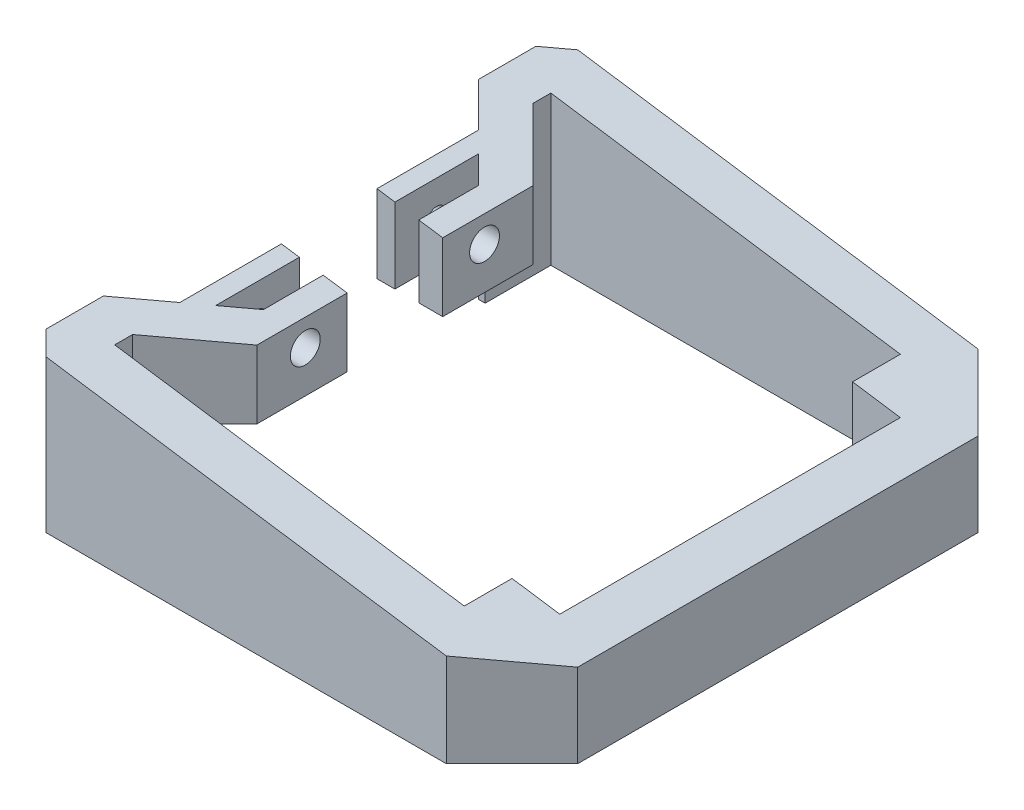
ISO-10303-21;
HEADER;
FILE_DESCRIPTION(('STEP AP214'),'2;1');
FILE_NAME('part.step','',(''),(''),'','','');
FILE_SCHEMA(('AUTOMOTIVE_DESIGN { 1 0 10303 214 1 1 1 1 }'));
ENDSEC;
DATA;
#1=APPLICATION_CONTEXT('core data for automotive mechanical design processes');
#2=APPLICATION_PROTOCOL_DEFINITION('international standard','automotive_design',2000,#1);
#3=PRODUCT_CONTEXT('',#1,'mechanical');
#4=PRODUCT('Part','Part','',(#3));
#5=PRODUCT_RELATED_PRODUCT_CATEGORY('part','',(#4));
#6=PRODUCT_DEFINITION_FORMATION('','',#4);
#7=PRODUCT_DEFINITION_CONTEXT('part definition',#1,'design');
#8=PRODUCT_DEFINITION('design','',#6,#7);
#9=PRODUCT_DEFINITION_SHAPE('','',#8);
#10=(LENGTH_UNIT() NAMED_UNIT(*) SI_UNIT(.MILLI.,.METRE.));
#11=(NAMED_UNIT(*) PLANE_ANGLE_UNIT() SI_UNIT($,.RADIAN.));
#12=(NAMED_UNIT(*) SI_UNIT($,.STERADIAN.) SOLID_ANGLE_UNIT());
#13=UNCERTAINTY_MEASURE_WITH_UNIT(LENGTH_MEASURE(1.E-05),#10,'distance_accuracy_value','');
#14=(GEOMETRIC_REPRESENTATION_CONTEXT(3) GLOBAL_UNCERTAINTY_ASSIGNED_CONTEXT((#13)) GLOBAL_UNIT_ASSIGNED_CONTEXT((#10,
#11,#12)) REPRESENTATION_CONTEXT('',''));
#15=CARTESIAN_POINT('',(0.,0.,0.));
#16=DIRECTION('',(0.,0.,1.));
#17=DIRECTION('',(1.,0.,0.));
#18=AXIS2_PLACEMENT_3D('',#15,#16,#17);
#19=CARTESIAN_POINT('',(1.45000000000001,6.,7.19999999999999));
#20=DIRECTION('',(1.,0.,0.));
#21=DIRECTION('',(0.,0.,-1.));
#22=AXIS2_PLACEMENT_3D('',#19,#20,#21);
#23=PLANE('',#22);
#24=CARTESIAN_POINT('',(1.45000000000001,9.5,9.25));
#25=DIRECTION('',(1.,0.,0.));
#26=DIRECTION('',(0.,0.,-1.));
#27=AXIS2_PLACEMENT_3D('',#24,#25,#26);
#28=CIRCLE('',#27,0.75);
#29=CARTESIAN_POINT('',(1.45000000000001,9.5,8.5));
#30=VERTEX_POINT('',#29);
#31=EDGE_CURVE('E556',#30,#30,#28,.T.);
#32=ORIENTED_EDGE('',*,*,#31,.T.);
#33=EDGE_LOOP('',(#32));
#34=FACE_BOUND('',#33,.T.);
#35=DIRECTION('',(0.,0.,1.));
#36=VECTOR('',#35,1.);
#37=CARTESIAN_POINT('',(1.45000000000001,6.,4.25));
#38=LINE('',#37,#36);
#39=CARTESIAN_POINT('',(1.45000000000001,6.,4.25));
#40=VERTEX_POINT('',#39);
#41=CARTESIAN_POINT('',(1.45000000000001,6.,12.75));
#42=VERTEX_POINT('',#41);
#43=EDGE_CURVE('E442',#40,#42,#38,.T.);
#44=ORIENTED_EDGE('',*,*,#43,.T.);
#45=DIRECTION('',(0.,-1.,0.));
#46=VECTOR('',#45,1.);
#47=CARTESIAN_POINT('',(1.45000000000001,6.,12.75));
#48=LINE('',#47,#46);
#49=CARTESIAN_POINT('',(1.45000000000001,12.5288343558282,12.75));
#50=VERTEX_POINT('',#49);
#51=EDGE_CURVE('E401',#50,#42,#48,.T.);
#52=ORIENTED_EDGE('',*,*,#51,.F.);
#53=DIRECTION('',(0.,0.,-1.));
#54=VECTOR('',#53,1.);
#55=CARTESIAN_POINT('',(1.45000000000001,12.5288343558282,7.19999999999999));
#56=LINE('',#55,#54);
#57=CARTESIAN_POINT('',(1.45000000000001,12.5288343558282,4.25));
#58=VERTEX_POINT('',#57);
#59=EDGE_CURVE('E652',#50,#58,#56,.T.);
#60=ORIENTED_EDGE('',*,*,#59,.T.);
#61=DIRECTION('',(0.,-1.,0.));
#62=VECTOR('',#61,1.);
#63=CARTESIAN_POINT('',(1.45000000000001,13.,4.25));
#64=LINE('',#63,#62);
#65=EDGE_CURVE('E450',#58,#40,#64,.T.);
#66=ORIENTED_EDGE('',*,*,#65,.T.);
#67=EDGE_LOOP('',(#44,#52,#60,#66));
#68=FACE_BOUND('',#67,.T.);
#69=ADVANCED_FACE('F36',(#34,#68),#23,.F.);
#70=CARTESIAN_POINT('',(1.45000000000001,9.5,24.25));
#71=DIRECTION('',(1.,0.,0.));
#72=DIRECTION('',(0.,0.,-1.));
#73=AXIS2_PLACEMENT_3D('',#70,#71,#72);
#74=CIRCLE('',#73,0.750000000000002);
#75=CARTESIAN_POINT('',(1.45000000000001,9.5,23.5));
#76=VERTEX_POINT('',#75);
#77=EDGE_CURVE('E381',#76,#76,#74,.T.);
#78=ORIENTED_EDGE('',*,*,#77,.T.);
#79=EDGE_LOOP('',(#78));
#80=FACE_BOUND('',#79,.T.);
#81=DIRECTION('',(0.,1.,0.));
#82=VECTOR('',#81,1.);
#83=CARTESIAN_POINT('',(1.45000000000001,6.,20.75));
#84=LINE('',#83,#82);
#85=CARTESIAN_POINT('',(1.45000000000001,6.,20.75));
#86=VERTEX_POINT('',#85);
#87=CARTESIAN_POINT('',(1.45000000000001,12.5288343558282,20.75));
#88=VERTEX_POINT('',#87);
#89=EDGE_CURVE('E394',#86,#88,#84,.T.);
#90=ORIENTED_EDGE('',*,*,#89,.F.);
#91=CARTESIAN_POINT('',(1.45000000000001,6.,29.25));
#92=VERTEX_POINT('',#91);
#93=EDGE_CURVE('E51',#86,#92,#38,.T.);
#94=ORIENTED_EDGE('',*,*,#93,.T.);
#95=DIRECTION('',(0.,-1.,0.));
#96=VECTOR('',#95,1.);
#97=CARTESIAN_POINT('',(1.45000000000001,13.,29.25));
#98=LINE('',#97,#96);
#99=CARTESIAN_POINT('',(1.45000000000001,12.5288343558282,29.25));
#100=VERTEX_POINT('',#99);
#101=EDGE_CURVE('E447',#100,#92,#98,.T.);
#102=ORIENTED_EDGE('',*,*,#101,.F.);
#103=DIRECTION('',(0.,0.,-1.));
#104=VECTOR('',#103,1.);
#105=CARTESIAN_POINT('',(1.45000000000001,12.5288343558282,7.19999999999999));
#106=LINE('',#105,#104);
#107=EDGE_CURVE('E587',#100,#88,#106,.T.);
#108=ORIENTED_EDGE('',*,*,#107,.T.);
#109=EDGE_LOOP('',(#90,#94,#102,#108));
#110=FACE_BOUND('',#109,.T.);
#111=ADVANCED_FACE('F690',(#80,#110),#23,.F.);
#112=CARTESIAN_POINT('',(6.95,6.,5.19999999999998));
#113=DIRECTION('',(1.,0.,0.));
#114=DIRECTION('',(0.,0.,-1.));
#115=AXIS2_PLACEMENT_3D('',#112,#113,#114);
#116=PLANE('',#115);
#117=CARTESIAN_POINT('',(6.95,9.5,9.25));
#118=DIRECTION('',(1.,0.,0.));
#119=DIRECTION('',(0.,0.,-1.));
#120=AXIS2_PLACEMENT_3D('',#117,#118,#119);
#121=CIRCLE('',#120,1.25);
#122=CARTESIAN_POINT('',(6.95,9.5,8.));
#123=VERTEX_POINT('',#122);
#124=EDGE_CURVE('E404',#123,#123,#121,.T.);
#125=ORIENTED_EDGE('',*,*,#124,.F.);
#126=EDGE_LOOP('',(#125));
#127=FACE_BOUND('',#126,.T.);
#128=DIRECTION('',(0.,-1.,0.));
#129=VECTOR('',#128,1.);
#130=CARTESIAN_POINT('',(6.95,13.,12.75));
#131=LINE('',#130,#129);
#132=CARTESIAN_POINT('',(6.95,11.719018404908,12.75));
#133=VERTEX_POINT('',#132);
#134=CARTESIAN_POINT('',(6.95,6.,12.75));
#135=VERTEX_POINT('',#134);
#136=EDGE_CURVE('E374',#133,#135,#131,.T.);
#137=ORIENTED_EDGE('',*,*,#136,.T.);
#138=DIRECTION('',(0.,0.,-1.));
#139=VECTOR('',#138,1.);
#140=CARTESIAN_POINT('',(6.95,6.,28.3));
#141=LINE('',#140,#139);
#142=CARTESIAN_POINT('',(6.95,6.,5.19999999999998));
#143=VERTEX_POINT('',#142);
#144=EDGE_CURVE('E59',#135,#143,#141,.T.);
#145=ORIENTED_EDGE('',*,*,#144,.T.);
#146=DIRECTION('',(0.,-1.,0.));
#147=VECTOR('',#146,1.);
#148=CARTESIAN_POINT('',(6.95,6.,5.19999999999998));
#149=LINE('',#148,#147);
#150=CARTESIAN_POINT('',(6.95,11.719018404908,5.19999999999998));
#151=VERTEX_POINT('',#150);
#152=EDGE_CURVE('E376',#151,#143,#149,.T.);
#153=ORIENTED_EDGE('',*,*,#152,.F.);
#154=DIRECTION('',(0.,0.,-1.));
#155=VECTOR('',#154,1.);
#156=CARTESIAN_POINT('',(6.95,11.719018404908,5.19999999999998));
#157=LINE('',#156,#155);
#158=EDGE_CURVE('E363',#133,#151,#157,.T.);
#159=ORIENTED_EDGE('',*,*,#158,.F.);
#160=EDGE_LOOP('',(#137,#145,#153,#159));
#161=FACE_BOUND('',#160,.T.);
#162=ADVANCED_FACE('F373',(#127,#161),#116,.T.);
#163=CARTESIAN_POINT('',(6.95,9.5,24.25));
#164=DIRECTION('',(1.,0.,0.));
#165=DIRECTION('',(0.,0.,-1.));
#166=AXIS2_PLACEMENT_3D('',#163,#164,#165);
#167=CIRCLE('',#166,1.25);
#168=CARTESIAN_POINT('',(6.95,9.5,23.));
#169=VERTEX_POINT('',#168);
#170=EDGE_CURVE('E408',#169,#169,#167,.T.);
#171=ORIENTED_EDGE('',*,*,#170,.F.);
#172=EDGE_LOOP('',(#171));
#173=FACE_BOUND('',#172,.T.);
#174=DIRECTION('',(0.,-1.,0.));
#175=VECTOR('',#174,1.);
#176=CARTESIAN_POINT('',(6.95,6.,28.3));
#177=LINE('',#176,#175);
#178=CARTESIAN_POINT('',(6.95,11.719018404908,28.3));
#179=VERTEX_POINT('',#178);
#180=CARTESIAN_POINT('',(6.95,6.,28.3));
#181=VERTEX_POINT('',#180);
#182=EDGE_CURVE('E508',#179,#181,#177,.T.);
#183=ORIENTED_EDGE('',*,*,#182,.T.);
#184=CARTESIAN_POINT('',(6.95,6.,20.75));
#185=VERTEX_POINT('',#184);
#186=EDGE_CURVE('E830',#181,#185,#141,.T.);
#187=ORIENTED_EDGE('',*,*,#186,.T.);
#188=DIRECTION('',(0.,1.,0.));
#189=VECTOR('',#188,1.);
#190=CARTESIAN_POINT('',(6.95,13.,20.75));
#191=LINE('',#190,#189);
#192=CARTESIAN_POINT('',(6.95,11.719018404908,20.75));
#193=VERTEX_POINT('',#192);
#194=EDGE_CURVE('E380',#185,#193,#191,.T.);
#195=ORIENTED_EDGE('',*,*,#194,.T.);
#196=DIRECTION('',(0.,0.,-1.));
#197=VECTOR('',#196,1.);
#198=CARTESIAN_POINT('',(6.95,11.719018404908,5.19999999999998));
#199=LINE('',#198,#197);
#200=EDGE_CURVE('E649',#179,#193,#199,.T.);
#201=ORIENTED_EDGE('',*,*,#200,.F.);
#202=EDGE_LOOP('',(#183,#187,#195,#201));
#203=FACE_BOUND('',#202,.T.);
#204=ADVANCED_FACE('F973',(#173,#203),#116,.T.);
#205=CARTESIAN_POINT('',(2.95000000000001,6.,8.69999999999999));
#206=DIRECTION('',(1.,0.,0.));
#207=DIRECTION('',(0.,0.,-1.));
#208=AXIS2_PLACEMENT_3D('',#205,#206,#207);
#209=PLANE('',#208);
#210=CARTESIAN_POINT('',(2.95000000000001,9.5,9.25));
#211=DIRECTION('',(1.,0.,0.));
#212=DIRECTION('',(0.,0.,-1.));
#213=AXIS2_PLACEMENT_3D('',#210,#211,#212);
#214=CIRCLE('',#213,0.75);
#215=CARTESIAN_POINT('',(2.95000000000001,9.5,8.5));
#216=VERTEX_POINT('',#215);
#217=EDGE_CURVE('E547',#216,#216,#214,.T.);
#218=ORIENTED_EDGE('',*,*,#217,.F.);
#219=EDGE_LOOP('',(#218));
#220=FACE_BOUND('',#219,.T.);
#221=DIRECTION('',(0.,-1.,0.));
#222=VECTOR('',#221,1.);
#223=CARTESIAN_POINT('',(2.95000000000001,6.,12.75));
#224=LINE('',#223,#222);
#225=CARTESIAN_POINT('',(2.95000000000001,12.3079754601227,12.75));
#226=VERTEX_POINT('',#225);
#227=CARTESIAN_POINT('',(2.95000000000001,6.,12.75));
#228=VERTEX_POINT('',#227);
#229=EDGE_CURVE('E398',#226,#228,#224,.T.);
#230=ORIENTED_EDGE('',*,*,#229,.T.);
#231=DIRECTION('',(0.,0.,1.));
#232=VECTOR('',#231,1.);
#233=CARTESIAN_POINT('',(2.95000000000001,6.,5.75));
#234=LINE('',#233,#232);
#235=CARTESIAN_POINT('',(2.95000000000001,6.,5.75));
#236=VERTEX_POINT('',#235);
#237=EDGE_CURVE('E419',#236,#228,#234,.T.);
#238=ORIENTED_EDGE('',*,*,#237,.F.);
#239=DIRECTION('',(0.,-1.,0.));
#240=VECTOR('',#239,1.);
#241=CARTESIAN_POINT('',(2.95000000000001,13.,5.75));
#242=LINE('',#241,#240);
#243=CARTESIAN_POINT('',(2.95000000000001,12.3079754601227,5.75));
#244=VERTEX_POINT('',#243);
#245=EDGE_CURVE('E435',#244,#236,#242,.T.);
#246=ORIENTED_EDGE('',*,*,#245,.F.);
#247=DIRECTION('',(0.,0.,-1.));
#248=VECTOR('',#247,1.);
#249=CARTESIAN_POINT('',(2.95000000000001,12.3079754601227,8.69999999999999));
#250=LINE('',#249,#248);
#251=EDGE_CURVE('E629',#226,#244,#250,.T.);
#252=ORIENTED_EDGE('',*,*,#251,.F.);
#253=EDGE_LOOP('',(#230,#238,#246,#252));
#254=FACE_BOUND('',#253,.T.);
#255=ADVANCED_FACE('F568',(#220,#254),#209,.T.);
#256=CARTESIAN_POINT('',(2.95000000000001,9.5,24.25));
#257=DIRECTION('',(1.,0.,0.));
#258=DIRECTION('',(0.,0.,-1.));
#259=AXIS2_PLACEMENT_3D('',#256,#257,#258);
#260=CIRCLE('',#259,0.750000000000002);
#261=CARTESIAN_POINT('',(2.95000000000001,9.5,23.5));
#262=VERTEX_POINT('',#261);
#263=EDGE_CURVE('E386',#262,#262,#260,.T.);
#264=ORIENTED_EDGE('',*,*,#263,.F.);
#265=EDGE_LOOP('',(#264));
#266=FACE_BOUND('',#265,.T.);
#267=CARTESIAN_POINT('',(2.95000000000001,6.,20.75));
#268=VERTEX_POINT('',#267);
#269=CARTESIAN_POINT('',(2.95000000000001,6.,27.75));
#270=VERTEX_POINT('',#269);
#271=EDGE_CURVE('E418',#268,#270,#234,.T.);
#272=ORIENTED_EDGE('',*,*,#271,.F.);
#273=DIRECTION('',(0.,1.,0.));
#274=VECTOR('',#273,1.);
#275=CARTESIAN_POINT('',(2.95000000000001,6.,20.75));
#276=LINE('',#275,#274);
#277=CARTESIAN_POINT('',(2.95000000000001,12.3079754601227,20.75));
#278=VERTEX_POINT('',#277);
#279=EDGE_CURVE('E392',#268,#278,#276,.T.);
#280=ORIENTED_EDGE('',*,*,#279,.T.);
#281=DIRECTION('',(0.,0.,-1.));
#282=VECTOR('',#281,1.);
#283=CARTESIAN_POINT('',(2.95000000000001,12.3079754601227,8.69999999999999));
#284=LINE('',#283,#282);
#285=CARTESIAN_POINT('',(2.95000000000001,12.3079754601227,27.75));
#286=VERTEX_POINT('',#285);
#287=EDGE_CURVE('E588',#286,#278,#284,.T.);
#288=ORIENTED_EDGE('',*,*,#287,.F.);
#289=DIRECTION('',(0.,-1.,0.));
#290=VECTOR('',#289,1.);
#291=CARTESIAN_POINT('',(2.95000000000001,13.,27.75));
#292=LINE('',#291,#290);
#293=EDGE_CURVE('E432',#286,#270,#292,.T.);
#294=ORIENTED_EDGE('',*,*,#293,.T.);
#295=EDGE_LOOP('',(#272,#280,#288,#294));
#296=FACE_BOUND('',#295,.T.);
#297=ADVANCED_FACE('F564',(#266,#296),#209,.T.);
#298=CARTESIAN_POINT('',(4.95,6.,22.8));
#299=DIRECTION('',(-1.,0.,0.));
#300=DIRECTION('',(0.,0.,1.));
#301=AXIS2_PLACEMENT_3D('',#298,#299,#300);
#302=PLANE('',#301);
#303=CARTESIAN_POINT('',(4.95,9.5,9.25));
#304=DIRECTION('',(1.,0.,0.));
#305=DIRECTION('',(0.,0.,-1.));
#306=AXIS2_PLACEMENT_3D('',#303,#304,#305);
#307=CIRCLE('',#306,1.25);
#308=CARTESIAN_POINT('',(4.95,9.5,8.));
#309=VERTEX_POINT('',#308);
#310=EDGE_CURVE('E405',#309,#309,#307,.T.);
#311=ORIENTED_EDGE('',*,*,#310,.T.);
#312=EDGE_LOOP('',(#311));
#313=FACE_BOUND('',#312,.T.);
#314=DIRECTION('',(0.,0.,-1.));
#315=VECTOR('',#314,1.);
#316=CARTESIAN_POINT('',(4.95000000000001,6.,7.75));
#317=LINE('',#316,#315);
#318=CARTESIAN_POINT('',(4.95,6.,12.75));
#319=VERTEX_POINT('',#318);
#320=CARTESIAN_POINT('',(4.95,6.,7.75));
#321=VERTEX_POINT('',#320);
#322=EDGE_CURVE('E423',#319,#321,#317,.T.);
#323=ORIENTED_EDGE('',*,*,#322,.F.);
#324=DIRECTION('',(0.,1.,0.));
#325=VECTOR('',#324,1.);
#326=CARTESIAN_POINT('',(4.95,6.,12.75));
#327=LINE('',#326,#325);
#328=CARTESIAN_POINT('',(4.95,12.0134969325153,12.75));
#329=VERTEX_POINT('',#328);
#330=EDGE_CURVE('E396',#319,#329,#327,.T.);
#331=ORIENTED_EDGE('',*,*,#330,.T.);
#332=DIRECTION('',(0.,0.,1.));
#333=VECTOR('',#332,1.);
#334=CARTESIAN_POINT('',(4.95,12.0134969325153,22.8));
#335=LINE('',#334,#333);
#336=CARTESIAN_POINT('',(4.95,12.0134969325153,7.75));
#337=VERTEX_POINT('',#336);
#338=EDGE_CURVE('E366',#337,#329,#335,.T.);
#339=ORIENTED_EDGE('',*,*,#338,.F.);
#340=DIRECTION('',(0.,-1.,0.));
#341=VECTOR('',#340,1.);
#342=CARTESIAN_POINT('',(4.95000000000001,13.,7.75));
#343=LINE('',#342,#341);
#344=EDGE_CURVE('E426',#337,#321,#343,.T.);
#345=ORIENTED_EDGE('',*,*,#344,.T.);
#346=EDGE_LOOP('',(#323,#331,#339,#345));
#347=FACE_BOUND('',#346,.T.);
#348=ADVANCED_FACE('F567',(#313,#347),#302,.T.);
#349=CARTESIAN_POINT('',(4.95,9.5,24.25));
#350=DIRECTION('',(1.,0.,0.));
#351=DIRECTION('',(0.,0.,-1.));
#352=AXIS2_PLACEMENT_3D('',#349,#350,#351);
#353=CIRCLE('',#352,1.25);
#354=CARTESIAN_POINT('',(4.95,9.5,23.));
#355=VERTEX_POINT('',#354);
#356=EDGE_CURVE('E411',#355,#355,#353,.T.);
#357=ORIENTED_EDGE('',*,*,#356,.T.);
#358=EDGE_LOOP('',(#357));
#359=FACE_BOUND('',#358,.T.);
#360=DIRECTION('',(0.,-1.,0.));
#361=VECTOR('',#360,1.);
#362=CARTESIAN_POINT('',(4.95,6.,20.75));
#363=LINE('',#362,#361);
#364=CARTESIAN_POINT('',(4.95,12.0134969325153,20.75));
#365=VERTEX_POINT('',#364);
#366=CARTESIAN_POINT('',(4.95,6.,20.75));
#367=VERTEX_POINT('',#366);
#368=EDGE_CURVE('E383',#365,#367,#363,.T.);
#369=ORIENTED_EDGE('',*,*,#368,.T.);
#370=CARTESIAN_POINT('',(4.95000000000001,6.,25.75));
#371=VERTEX_POINT('',#370);
#372=EDGE_CURVE('E424',#371,#367,#317,.T.);
#373=ORIENTED_EDGE('',*,*,#372,.F.);
#374=DIRECTION('',(0.,-1.,0.));
#375=VECTOR('',#374,1.);
#376=CARTESIAN_POINT('',(4.95000000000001,13.,25.75));
#377=LINE('',#376,#375);
#378=CARTESIAN_POINT('',(4.95,12.0134969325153,25.75));
#379=VERTEX_POINT('',#378);
#380=EDGE_CURVE('E429',#379,#371,#377,.T.);
#381=ORIENTED_EDGE('',*,*,#380,.F.);
#382=DIRECTION('',(0.,0.,1.));
#383=VECTOR('',#382,1.);
#384=CARTESIAN_POINT('',(4.95,12.0134969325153,22.8));
#385=LINE('',#384,#383);
#386=EDGE_CURVE('E658',#365,#379,#385,.T.);
#387=ORIENTED_EDGE('',*,*,#386,.F.);
#388=EDGE_LOOP('',(#369,#373,#381,#387));
#389=FACE_BOUND('',#388,.T.);
#390=ADVANCED_FACE('F675',(#359,#389),#302,.T.);
#391=CARTESIAN_POINT('',(1.75,6.,0.));
#392=DIRECTION('',(0.707106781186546,0.,-0.707106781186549));
#393=DIRECTION('',(-0.707106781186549,0.,-0.707106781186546));
#394=AXIS2_PLACEMENT_3D('',#391,#392,#393);
#395=PLANE('',#394);
#396=ORIENTED_EDGE('',*,*,#152,.T.);
#397=DIRECTION('',(-0.707106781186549,0.,-0.707106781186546));
#398=VECTOR('',#397,1.);
#399=CARTESIAN_POINT('',(6.95,6.,5.19999999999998));
#400=LINE('',#399,#398);
#401=CARTESIAN_POINT('',(1.75,6.,0.));
#402=VERTEX_POINT('',#401);
#403=EDGE_CURVE('E832',#143,#402,#400,.T.);
#404=ORIENTED_EDGE('',*,*,#403,.T.);
#405=DIRECTION('',(0.,-1.,0.));
#406=VECTOR('',#405,1.);
#407=CARTESIAN_POINT('',(1.75,6.,0.));
#408=LINE('',#407,#406);
#409=CARTESIAN_POINT('',(1.75,12.4846625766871,0.));
#410=VERTEX_POINT('',#409);
#411=EDGE_CURVE('E512',#410,#402,#408,.T.);
#412=ORIENTED_EDGE('',*,*,#411,.F.);
#413=DIRECTION('',(-0.703305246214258,0.103554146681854,-0.703305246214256));
#414=VECTOR('',#413,1.);
#415=CARTESIAN_POINT('',(2.2222791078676,12.4151245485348,0.472279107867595));
#416=LINE('',#415,#414);
#417=EDGE_CURVE('E623',#151,#410,#416,.T.);
#418=ORIENTED_EDGE('',*,*,#417,.F.);
#419=EDGE_LOOP('',(#396,#404,#412,#418));
#420=FACE_BOUND('',#419,.T.);
#421=ADVANCED_FACE('F677',(#420),#395,.T.);
#422=CARTESIAN_POINT('',(1.75,6.,33.5));
#423=DIRECTION('',(0.707106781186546,0.,0.707106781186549));
#424=DIRECTION('',(0.707106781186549,0.,-0.707106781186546));
#425=AXIS2_PLACEMENT_3D('',#422,#423,#424);
#426=PLANE('',#425);
#427=DIRECTION('',(0.,-1.,0.));
#428=VECTOR('',#427,1.);
#429=CARTESIAN_POINT('',(1.75,6.,33.5));
#430=LINE('',#429,#428);
#431=CARTESIAN_POINT('',(1.75,12.4846625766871,33.5));
#432=VERTEX_POINT('',#431);
#433=CARTESIAN_POINT('',(1.75,6.,33.5));
#434=VERTEX_POINT('',#433);
#435=EDGE_CURVE('E505',#432,#434,#430,.T.);
#436=ORIENTED_EDGE('',*,*,#435,.T.);
#437=DIRECTION('',(0.707106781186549,0.,-0.707106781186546));
#438=VECTOR('',#437,1.);
#439=CARTESIAN_POINT('',(1.75,6.,33.5));
#440=LINE('',#439,#438);
#441=EDGE_CURVE('E827',#434,#181,#440,.T.);
#442=ORIENTED_EDGE('',*,*,#441,.T.);
#443=ORIENTED_EDGE('',*,*,#182,.F.);
#444=DIRECTION('',(0.703305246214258,-0.103554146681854,-0.703305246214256));
#445=VECTOR('',#444,1.);
#446=CARTESIAN_POINT('',(2.2222791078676,12.4151245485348,33.0277208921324));
#447=LINE('',#446,#445);
#448=EDGE_CURVE('E647',#432,#179,#447,.T.);
#449=ORIENTED_EDGE('',*,*,#448,.F.);
#450=EDGE_LOOP('',(#436,#442,#443,#449));
#451=FACE_BOUND('',#450,.T.);
#452=ADVANCED_FACE('F684',(#451),#426,.T.);
#453=CARTESIAN_POINT('',(-1.05,13.,20.75));
#454=DIRECTION('',(0.,0.,-1.));
#455=DIRECTION('',(0.,1.,0.));
#456=AXIS2_PLACEMENT_3D('',#453,#454,#455);
#457=PLANE('',#456);
#458=ORIENTED_EDGE('',*,*,#194,.F.);
#459=DIRECTION('',(-1.,0.,0.));
#460=VECTOR('',#459,1.);
#461=CARTESIAN_POINT('',(-1.05,6.,20.75));
#462=LINE('',#461,#460);
#463=EDGE_CURVE('E579',#185,#367,#462,.T.);
#464=ORIENTED_EDGE('',*,*,#463,.T.);
#465=ORIENTED_EDGE('',*,*,#368,.F.);
#466=DIRECTION('',(-0.989333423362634,0.14566872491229,0.));
#467=VECTOR('',#466,1.);
#468=CARTESIAN_POINT('',(-1.0648535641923,12.899119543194,20.75));
#469=LINE('',#468,#467);
#470=EDGE_CURVE('E655',#193,#365,#469,.T.);
#471=ORIENTED_EDGE('',*,*,#470,.F.);
#472=EDGE_LOOP('',(#458,#464,#465,#471));
#473=FACE_BOUND('',#472,.T.);
#474=ADVANCED_FACE('F671',(#473),#457,.T.);
#475=ORIENTED_EDGE('',*,*,#279,.F.);
#476=DIRECTION('',(-1.,0.,0.));
#477=VECTOR('',#476,1.);
#478=CARTESIAN_POINT('',(-1.05,6.,20.75));
#479=LINE('',#478,#477);
#480=EDGE_CURVE('E575',#268,#86,#479,.T.);
#481=ORIENTED_EDGE('',*,*,#480,.T.);
#482=ORIENTED_EDGE('',*,*,#89,.T.);
#483=DIRECTION('',(-0.989333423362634,0.14566872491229,0.));
#484=VECTOR('',#483,1.);
#485=CARTESIAN_POINT('',(-1.0648535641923,12.899119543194,20.75));
#486=LINE('',#485,#484);
#487=EDGE_CURVE('E585',#278,#88,#486,.T.);
#488=ORIENTED_EDGE('',*,*,#487,.F.);
#489=EDGE_LOOP('',(#475,#481,#482,#488));
#490=FACE_BOUND('',#489,.T.);
#491=ADVANCED_FACE('F583',(#490),#457,.T.);
#492=CARTESIAN_POINT('',(-1.05,13.,12.75));
#493=DIRECTION('',(0.,0.,1.));
#494=DIRECTION('',(0.,-1.,0.));
#495=AXIS2_PLACEMENT_3D('',#492,#493,#494);
#496=PLANE('',#495);
#497=ORIENTED_EDGE('',*,*,#51,.T.);
#498=DIRECTION('',(1.,0.,0.));
#499=VECTOR('',#498,1.);
#500=CARTESIAN_POINT('',(-1.05,6.,12.75));
#501=LINE('',#500,#499);
#502=EDGE_CURVE('E580',#42,#228,#501,.T.);
#503=ORIENTED_EDGE('',*,*,#502,.T.);
#504=ORIENTED_EDGE('',*,*,#229,.F.);
#505=DIRECTION('',(0.989333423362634,-0.14566872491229,0.));
#506=VECTOR('',#505,1.);
#507=CARTESIAN_POINT('',(-1.0648535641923,12.899119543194,12.75));
#508=LINE('',#507,#506);
#509=EDGE_CURVE('E631',#50,#226,#508,.T.);
#510=ORIENTED_EDGE('',*,*,#509,.F.);
#511=EDGE_LOOP('',(#497,#503,#504,#510));
#512=FACE_BOUND('',#511,.T.);
#513=ADVANCED_FACE('F717',(#512),#496,.T.);
#514=ORIENTED_EDGE('',*,*,#330,.F.);
#515=DIRECTION('',(1.,0.,0.));
#516=VECTOR('',#515,1.);
#517=CARTESIAN_POINT('',(-1.05,6.,12.75));
#518=LINE('',#517,#516);
#519=EDGE_CURVE('E12',#319,#135,#518,.T.);
#520=ORIENTED_EDGE('',*,*,#519,.T.);
#521=ORIENTED_EDGE('',*,*,#136,.F.);
#522=DIRECTION('',(0.989333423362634,-0.14566872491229,0.));
#523=VECTOR('',#522,1.);
#524=CARTESIAN_POINT('',(-1.0648535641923,12.899119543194,12.75));
#525=LINE('',#524,#523);
#526=EDGE_CURVE('E44',#329,#133,#525,.T.);
#527=ORIENTED_EDGE('',*,*,#526,.F.);
#528=EDGE_LOOP('',(#514,#520,#521,#527));
#529=FACE_BOUND('',#528,.T.);
#530=ADVANCED_FACE('F379',(#529),#496,.T.);
#531=CARTESIAN_POINT('',(0.,0.,0.));
#532=DIRECTION('',(0.,-1.,0.));
#533=DIRECTION('',(0.,0.,-1.));
#534=AXIS2_PLACEMENT_3D('',#531,#532,#533);
#535=PLANE('',#534);
#536=DIRECTION('',(-0.707106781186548,0.,0.707106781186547));
#537=VECTOR('',#536,1.);
#538=CARTESIAN_POINT('',(-1.75,0.,32.45));
#539=LINE('',#538,#537);
#540=CARTESIAN_POINT('',(1.20000000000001,0.,29.5));
#541=VERTEX_POINT('',#540);
#542=CARTESIAN_POINT('',(-1.75,0.,32.45));
#543=VERTEX_POINT('',#542);
#544=EDGE_CURVE('E739',#541,#543,#539,.T.);
#545=ORIENTED_EDGE('',*,*,#544,.F.);
#546=DIRECTION('',(-1.,0.,0.));
#547=VECTOR('',#546,1.);
#548=CARTESIAN_POINT('',(1.20000000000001,0.,29.5));
#549=LINE('',#548,#547);
#550=CARTESIAN_POINT('',(1.75,0.,29.5));
#551=VERTEX_POINT('',#550);
#552=EDGE_CURVE('E748',#551,#541,#549,.T.);
#553=ORIENTED_EDGE('',*,*,#552,.F.);
#554=DIRECTION('',(0.,0.,1.));
#555=VECTOR('',#554,1.);
#556=CARTESIAN_POINT('',(1.75,0.,35.));
#557=LINE('',#556,#555);
#558=CARTESIAN_POINT('',(1.75,0.,35.));
#559=VERTEX_POINT('',#558);
#560=EDGE_CURVE('E470',#551,#559,#557,.T.);
#561=ORIENTED_EDGE('',*,*,#560,.T.);
#562=DIRECTION('',(1.,0.,0.));
#563=VECTOR('',#562,1.);
#564=CARTESIAN_POINT('',(31.,0.,35.));
#565=LINE('',#564,#563);
#566=CARTESIAN_POINT('',(31.,0.,35.));
#567=VERTEX_POINT('',#566);
#568=EDGE_CURVE('E473',#559,#567,#565,.T.);
#569=ORIENTED_EDGE('',*,*,#568,.T.);
#570=DIRECTION('',(0.,0.,-1.));
#571=VECTOR('',#570,1.);
#572=CARTESIAN_POINT('',(31.,0.,31.));
#573=LINE('',#572,#571);
#574=CARTESIAN_POINT('',(31.,0.,31.));
#575=VERTEX_POINT('',#574);
#576=EDGE_CURVE('E476',#567,#575,#573,.T.);
#577=ORIENTED_EDGE('',*,*,#576,.T.);
#578=DIRECTION('',(1.,0.,0.));
#579=VECTOR('',#578,1.);
#580=CARTESIAN_POINT('',(35.,0.,31.));
#581=LINE('',#580,#579);
#582=CARTESIAN_POINT('',(35.,0.,31.));
#583=VERTEX_POINT('',#582);
#584=EDGE_CURVE('E479',#575,#583,#581,.T.);
#585=ORIENTED_EDGE('',*,*,#584,.T.);
#586=DIRECTION('',(0.,0.,-1.));
#587=VECTOR('',#586,1.);
#588=CARTESIAN_POINT('',(35.,0.,2.5));
#589=LINE('',#588,#587);
#590=CARTESIAN_POINT('',(35.,0.,2.5));
#591=VERTEX_POINT('',#590);
#592=EDGE_CURVE('E482',#583,#591,#589,.T.);
#593=ORIENTED_EDGE('',*,*,#592,.T.);
#594=DIRECTION('',(-1.,0.,0.));
#595=VECTOR('',#594,1.);
#596=CARTESIAN_POINT('',(31.,0.,2.5));
#597=LINE('',#596,#595);
#598=CARTESIAN_POINT('',(31.,0.,2.5));
#599=VERTEX_POINT('',#598);
#600=EDGE_CURVE('E485',#591,#599,#597,.T.);
#601=ORIENTED_EDGE('',*,*,#600,.T.);
#602=DIRECTION('',(0.,0.,-1.));
#603=VECTOR('',#602,1.);
#604=CARTESIAN_POINT('',(31.,0.,-1.5));
#605=LINE('',#604,#603);
#606=CARTESIAN_POINT('',(31.,0.,-1.5));
#607=VERTEX_POINT('',#606);
#608=EDGE_CURVE('E488',#599,#607,#605,.T.);
#609=ORIENTED_EDGE('',*,*,#608,.T.);
#610=DIRECTION('',(-1.,0.,0.));
#611=VECTOR('',#610,1.);
#612=CARTESIAN_POINT('',(1.75,0.,-1.5));
#613=LINE('',#612,#611);
#614=CARTESIAN_POINT('',(1.75,0.,-1.5));
#615=VERTEX_POINT('',#614);
#616=EDGE_CURVE('E465',#607,#615,#613,.T.);
#617=ORIENTED_EDGE('',*,*,#616,.T.);
#618=DIRECTION('',(0.,0.,1.));
#619=VECTOR('',#618,1.);
#620=CARTESIAN_POINT('',(1.75,0.,-1.5));
#621=LINE('',#620,#619);
#622=CARTESIAN_POINT('',(1.75,0.,3.99999999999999));
#623=VERTEX_POINT('',#622);
#624=EDGE_CURVE('E468',#615,#623,#621,.T.);
#625=ORIENTED_EDGE('',*,*,#624,.T.);
#626=DIRECTION('',(1.,0.,0.));
#627=VECTOR('',#626,1.);
#628=CARTESIAN_POINT('',(1.2,0.,3.99999999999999));
#629=LINE('',#628,#627);
#630=CARTESIAN_POINT('',(1.2,0.,3.99999999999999));
#631=VERTEX_POINT('',#630);
#632=EDGE_CURVE('E317',#631,#623,#629,.T.);
#633=ORIENTED_EDGE('',*,*,#632,.F.);
#634=DIRECTION('',(0.707106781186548,0.,0.707106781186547));
#635=VECTOR('',#634,1.);
#636=CARTESIAN_POINT('',(-1.75,0.,1.05));
#637=LINE('',#636,#635);
#638=CARTESIAN_POINT('',(-1.75,0.,1.05));
#639=VERTEX_POINT('',#638);
#640=EDGE_CURVE('E300',#639,#631,#637,.T.);
#641=ORIENTED_EDGE('',*,*,#640,.F.);
#642=DIRECTION('',(0.,0.,1.));
#643=VECTOR('',#642,1.);
#644=CARTESIAN_POINT('',(-1.75,0.,-3.75));
#645=LINE('',#644,#643);
#646=CARTESIAN_POINT('',(-1.75,0.,-3.75));
#647=VERTEX_POINT('',#646);
#648=EDGE_CURVE('E315',#647,#639,#645,.T.);
#649=ORIENTED_EDGE('',*,*,#648,.F.);
#650=DIRECTION('',(-0.707106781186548,0.,0.707106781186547));
#651=VECTOR('',#650,1.);
#652=CARTESIAN_POINT('',(-1.75,0.,-3.75));
#653=LINE('',#652,#651);
#654=CARTESIAN_POINT('',(0.,0.,-5.5));
#655=VERTEX_POINT('',#654);
#656=EDGE_CURVE('E324',#655,#647,#653,.T.);
#657=ORIENTED_EDGE('',*,*,#656,.F.);
#658=DIRECTION('',(-1.,0.,0.));
#659=VECTOR('',#658,1.);
#660=CARTESIAN_POINT('',(0.,0.,-5.5));
#661=LINE('',#660,#659);
#662=CARTESIAN_POINT('',(33.5,0.,-5.5));
#663=VERTEX_POINT('',#662);
#664=EDGE_CURVE('E328',#663,#655,#661,.T.);
#665=ORIENTED_EDGE('',*,*,#664,.F.);
#666=DIRECTION('',(-0.707106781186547,0.,-0.707106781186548));
#667=VECTOR('',#666,1.);
#668=CARTESIAN_POINT('',(33.5,0.,-5.5));
#669=LINE('',#668,#667);
#670=CARTESIAN_POINT('',(39.,0.,0.));
#671=VERTEX_POINT('',#670);
#672=EDGE_CURVE('E529',#671,#663,#669,.T.);
#673=ORIENTED_EDGE('',*,*,#672,.F.);
#674=DIRECTION('',(0.,0.,-1.));
#675=VECTOR('',#674,1.);
#676=CARTESIAN_POINT('',(39.,0.,0.));
#677=LINE('',#676,#675);
#678=CARTESIAN_POINT('',(39.,0.,33.5));
#679=VERTEX_POINT('',#678);
#680=EDGE_CURVE('E340',#679,#671,#677,.T.);
#681=ORIENTED_EDGE('',*,*,#680,.F.);
#682=DIRECTION('',(0.707106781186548,0.,-0.707106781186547));
#683=VECTOR('',#682,1.);
#684=CARTESIAN_POINT('',(39.,0.,33.5));
#685=LINE('',#684,#683);
#686=CARTESIAN_POINT('',(33.5,0.,39.));
#687=VERTEX_POINT('',#686);
#688=EDGE_CURVE('E337',#687,#679,#685,.T.);
#689=ORIENTED_EDGE('',*,*,#688,.F.);
#690=DIRECTION('',(1.,0.,0.));
#691=VECTOR('',#690,1.);
#692=CARTESIAN_POINT('',(33.5,0.,39.));
#693=LINE('',#692,#691);
#694=CARTESIAN_POINT('',(0.,0.,39.));
#695=VERTEX_POINT('',#694);
#696=EDGE_CURVE('E334',#695,#687,#693,.T.);
#697=ORIENTED_EDGE('',*,*,#696,.F.);
#698=DIRECTION('',(0.70710678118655,0.,0.707106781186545));
#699=VECTOR('',#698,1.);
#700=CARTESIAN_POINT('',(0.,0.,39.));
#701=LINE('',#700,#699);
#702=CARTESIAN_POINT('',(-1.75,0.,37.25));
#703=VERTEX_POINT('',#702);
#704=EDGE_CURVE('E326',#703,#695,#701,.T.);
#705=ORIENTED_EDGE('',*,*,#704,.F.);
#706=DIRECTION('',(0.,0.,1.));
#707=VECTOR('',#706,1.);
#708=CARTESIAN_POINT('',(-1.75,0.,29.5));
#709=LINE('',#708,#707);
#710=EDGE_CURVE('E323',#543,#703,#709,.T.);
#711=ORIENTED_EDGE('',*,*,#710,.F.);
#712=EDGE_LOOP('',(#545,#553,#561,#569,#577,#585,#593,#601,#609,#617,#625,#633,#641,#649,#657,
#665,#673,#681,#689,#697,#705,#711));
#713=FACE_BOUND('',#712,.T.);
#714=CARTESIAN_POINT('',(0.,0.,33.5));
#715=DIRECTION('',(0.,1.,0.));
#716=DIRECTION('',(0.,0.,1.));
#717=AXIS2_PLACEMENT_3D('',#714,#715,#716);
#718=CIRCLE('',#717,1.1);
#719=CARTESIAN_POINT('',(0.,0.,34.6));
#720=VERTEX_POINT('',#719);
#721=EDGE_CURVE('E520',#720,#720,#718,.T.);
#722=ORIENTED_EDGE('',*,*,#721,.T.);
#723=EDGE_LOOP('',(#722));
#724=FACE_BOUND('',#723,.T.);
#725=CARTESIAN_POINT('',(0.,0.,0.));
#726=DIRECTION('',(0.,1.,0.));
#727=DIRECTION('',(0.,0.,1.));
#728=AXIS2_PLACEMENT_3D('',#725,#726,#727);
#729=CIRCLE('',#728,1.1);
#730=CARTESIAN_POINT('',(0.,0.,1.1));
#731=VERTEX_POINT('',#730);
#732=EDGE_CURVE('E526',#731,#731,#729,.T.);
#733=ORIENTED_EDGE('',*,*,#732,.T.);
#734=EDGE_LOOP('',(#733));
#735=FACE_BOUND('',#734,.T.);
#736=CARTESIAN_POINT('',(33.5,0.,0.));
#737=DIRECTION('',(0.,1.,0.));
#738=DIRECTION('',(0.,0.,1.));
#739=AXIS2_PLACEMENT_3D('',#736,#737,#738);
#740=CIRCLE('',#739,1.1);
#741=CARTESIAN_POINT('',(33.5,0.,1.1));
#742=VERTEX_POINT('',#741);
#743=EDGE_CURVE('E523',#742,#742,#740,.T.);
#744=ORIENTED_EDGE('',*,*,#743,.T.);
#745=EDGE_LOOP('',(#744));
#746=FACE_BOUND('',#745,.T.);
#747=CARTESIAN_POINT('',(33.5,0.,33.5));
#748=DIRECTION('',(0.,1.,0.));
#749=DIRECTION('',(0.,0.,1.));
#750=AXIS2_PLACEMENT_3D('',#747,#748,#749);
#751=CIRCLE('',#750,1.1);
#752=CARTESIAN_POINT('',(33.5,0.,34.6));
#753=VERTEX_POINT('',#752);
#754=EDGE_CURVE('E517',#753,#753,#751,.T.);
#755=ORIENTED_EDGE('',*,*,#754,.T.);
#756=EDGE_LOOP('',(#755));
#757=FACE_BOUND('',#756,.T.);
#758=ADVANCED_FACE('F312',(#713,#724,#735,#746,#757),#535,.T.);
#759=CARTESIAN_POINT('',(33.5,6.,-5.5));
#760=DIRECTION('',(-0.707106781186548,0.,0.707106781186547));
#761=DIRECTION('',(0.707106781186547,0.,0.707106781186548));
#762=AXIS2_PLACEMENT_3D('',#759,#760,#761);
#763=PLANE('',#762);
#764=DIRECTION('',(0.,-1.,0.));
#765=VECTOR('',#764,1.);
#766=CARTESIAN_POINT('',(33.5,6.,-5.5));
#767=LINE('',#766,#765);
#768=CARTESIAN_POINT('',(33.5,7.80981595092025,-5.5));
#769=VERTEX_POINT('',#768);
#770=EDGE_CURVE('E357',#769,#663,#767,.T.);
#771=ORIENTED_EDGE('',*,*,#770,.F.);
#772=DIRECTION('',(0.703305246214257,-0.103554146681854,0.703305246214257));
#773=VECTOR('',#772,1.);
#774=CARTESIAN_POINT('',(33.6318092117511,7.79040845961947,-5.36819078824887));
#775=LINE('',#774,#773);
#776=CARTESIAN_POINT('',(39.,7.,0.));
#777=VERTEX_POINT('',#776);
#778=EDGE_CURVE('E543',#769,#777,#775,.T.);
#779=ORIENTED_EDGE('',*,*,#778,.T.);
#780=DIRECTION('',(0.,-1.,0.));
#781=VECTOR('',#780,1.);
#782=CARTESIAN_POINT('',(39.,6.,0.));
#783=LINE('',#782,#781);
#784=EDGE_CURVE('E343',#777,#671,#783,.T.);
#785=ORIENTED_EDGE('',*,*,#784,.T.);
#786=ORIENTED_EDGE('',*,*,#672,.T.);
#787=EDGE_LOOP('',(#771,#779,#785,#786));
#788=FACE_BOUND('',#787,.T.);
#789=ADVANCED_FACE('F38',(#788),#763,.F.);
#790=CARTESIAN_POINT('',(0.,6.,-5.5));
#791=DIRECTION('',(0.,0.,1.));
#792=DIRECTION('',(1.,0.,0.));
#793=AXIS2_PLACEMENT_3D('',#790,#791,#792);
#794=PLANE('',#793);
#795=DIRECTION('',(0.,-1.,0.));
#796=VECTOR('',#795,1.);
#797=CARTESIAN_POINT('',(0.,6.,-5.5));
#798=LINE('',#797,#796);
#799=CARTESIAN_POINT('',(0.,12.7423312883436,-5.5));
#800=VERTEX_POINT('',#799);
#801=EDGE_CURVE('E355',#800,#655,#798,.T.);
#802=ORIENTED_EDGE('',*,*,#801,.F.);
#803=DIRECTION('',(0.989333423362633,-0.14566872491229,0.));
#804=VECTOR('',#803,1.);
#805=CARTESIAN_POINT('',(-1.75,13.,-5.5));
#806=LINE('',#805,#804);
#807=EDGE_CURVE('E616',#800,#769,#806,.T.);
#808=ORIENTED_EDGE('',*,*,#807,.T.);
#809=ORIENTED_EDGE('',*,*,#770,.T.);
#810=ORIENTED_EDGE('',*,*,#664,.T.);
#811=EDGE_LOOP('',(#802,#808,#809,#810));
#812=FACE_BOUND('',#811,.T.);
#813=ADVANCED_FACE('F535',(#812),#794,.F.);
#814=CARTESIAN_POINT('',(-1.75,6.,-3.75));
#815=DIRECTION('',(0.707106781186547,0.,0.707106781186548));
#816=DIRECTION('',(0.707106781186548,0.,-0.707106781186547));
#817=AXIS2_PLACEMENT_3D('',#814,#815,#816);
#818=PLANE('',#817);
#819=DIRECTION('',(0.,-1.,0.));
#820=VECTOR('',#819,1.);
#821=CARTESIAN_POINT('',(-1.75,6.,-3.75));
#822=LINE('',#821,#820);
#823=CARTESIAN_POINT('',(-1.75,13.,-3.75));
#824=VERTEX_POINT('',#823);
#825=EDGE_CURVE('E322',#824,#647,#822,.T.);
#826=ORIENTED_EDGE('',*,*,#825,.F.);
#827=DIRECTION('',(0.703305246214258,-0.103554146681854,-0.703305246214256));
#828=VECTOR('',#827,1.);
#829=CARTESIAN_POINT('',(-1.24018877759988,12.924935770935,-4.25981122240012));
#830=LINE('',#829,#828);
#831=EDGE_CURVE('E542',#824,#800,#830,.T.);
#832=ORIENTED_EDGE('',*,*,#831,.T.);
#833=ORIENTED_EDGE('',*,*,#801,.T.);
#834=ORIENTED_EDGE('',*,*,#656,.T.);
#835=EDGE_LOOP('',(#826,#832,#833,#834));
#836=FACE_BOUND('',#835,.T.);
#837=ADVANCED_FACE('F540',(#836),#818,.F.);
#838=CARTESIAN_POINT('',(-1.75,6.,-3.75));
#839=DIRECTION('',(1.,0.,0.));
#840=DIRECTION('',(0.,0.,-1.));
#841=AXIS2_PLACEMENT_3D('',#838,#839,#840);
#842=PLANE('',#841);
#843=ORIENTED_EDGE('',*,*,#648,.T.);
#844=DIRECTION('',(0.,-1.,0.));
#845=VECTOR('',#844,1.);
#846=CARTESIAN_POINT('',(-1.75,13.,1.05));
#847=LINE('',#846,#845);
#848=CARTESIAN_POINT('',(-1.75,13.,1.05));
#849=VERTEX_POINT('',#848);
#850=EDGE_CURVE('E295',#849,#639,#847,.T.);
#851=ORIENTED_EDGE('',*,*,#850,.F.);
#852=DIRECTION('',(0.,0.,1.));
#853=VECTOR('',#852,1.);
#854=CARTESIAN_POINT('',(-1.75,13.,-3.75));
#855=LINE('',#854,#853);
#856=EDGE_CURVE('E307',#824,#849,#855,.T.);
#857=ORIENTED_EDGE('',*,*,#856,.F.);
#858=ORIENTED_EDGE('',*,*,#825,.T.);
#859=EDGE_LOOP('',(#843,#851,#857,#858));
#860=FACE_BOUND('',#859,.T.);
#861=ADVANCED_FACE('F320',(#860),#842,.F.);
#862=CARTESIAN_POINT('',(-1.75,6.,29.5));
#863=DIRECTION('',(1.,0.,0.));
#864=DIRECTION('',(0.,0.,-1.));
#865=AXIS2_PLACEMENT_3D('',#862,#863,#864);
#866=PLANE('',#865);
#867=DIRECTION('',(0.,-1.,0.));
#868=VECTOR('',#867,1.);
#869=CARTESIAN_POINT('',(-1.75,13.,32.45));
#870=LINE('',#869,#868);
#871=CARTESIAN_POINT('',(-1.75,13.,32.45));
#872=VERTEX_POINT('',#871);
#873=EDGE_CURVE('E306',#872,#543,#870,.T.);
#874=ORIENTED_EDGE('',*,*,#873,.T.);
#875=ORIENTED_EDGE('',*,*,#710,.T.);
#876=DIRECTION('',(0.,-1.,0.));
#877=VECTOR('',#876,1.);
#878=CARTESIAN_POINT('',(-1.75,6.,37.25));
#879=LINE('',#878,#877);
#880=CARTESIAN_POINT('',(-1.75,13.,37.25));
#881=VERTEX_POINT('',#880);
#882=EDGE_CURVE('E351',#881,#703,#879,.T.);
#883=ORIENTED_EDGE('',*,*,#882,.F.);
#884=DIRECTION('',(0.,0.,1.));
#885=VECTOR('',#884,1.);
#886=CARTESIAN_POINT('',(-1.75,13.,37.25));
#887=LINE('',#886,#885);
#888=EDGE_CURVE('E438',#872,#881,#887,.T.);
#889=ORIENTED_EDGE('',*,*,#888,.F.);
#890=EDGE_LOOP('',(#874,#875,#883,#889));
#891=FACE_BOUND('',#890,.T.);
#892=ADVANCED_FACE('F700',(#891),#866,.F.);
#893=CARTESIAN_POINT('',(0.,6.,39.));
#894=DIRECTION('',(0.707106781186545,0.,-0.70710678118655));
#895=DIRECTION('',(-0.70710678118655,0.,-0.707106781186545));
#896=AXIS2_PLACEMENT_3D('',#893,#894,#895);
#897=PLANE('',#896);
#898=DIRECTION('',(0.,-1.,0.));
#899=VECTOR('',#898,1.);
#900=CARTESIAN_POINT('',(0.,6.,39.));
#901=LINE('',#900,#899);
#902=CARTESIAN_POINT('',(0.,12.7423312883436,39.));
#903=VERTEX_POINT('',#902);
#904=EDGE_CURVE('E349',#903,#695,#901,.T.);
#905=ORIENTED_EDGE('',*,*,#904,.F.);
#906=DIRECTION('',(-0.703305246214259,0.103554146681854,-0.703305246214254));
#907=VECTOR('',#906,1.);
#908=CARTESIAN_POINT('',(0.49104516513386,12.6700301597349,39.4910451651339));
#909=LINE('',#908,#907);
#910=EDGE_CURVE('E544',#903,#881,#909,.T.);
#911=ORIENTED_EDGE('',*,*,#910,.T.);
#912=ORIENTED_EDGE('',*,*,#882,.T.);
#913=ORIENTED_EDGE('',*,*,#704,.T.);
#914=EDGE_LOOP('',(#905,#911,#912,#913));
#915=FACE_BOUND('',#914,.T.);
#916=ADVANCED_FACE('F728',(#915),#897,.F.);
#917=CARTESIAN_POINT('',(33.5,6.,39.));
#918=DIRECTION('',(0.,0.,-1.));
#919=DIRECTION('',(-1.,0.,0.));
#920=AXIS2_PLACEMENT_3D('',#917,#918,#919);
#921=PLANE('',#920);
#922=DIRECTION('',(0.,-1.,0.));
#923=VECTOR('',#922,1.);
#924=CARTESIAN_POINT('',(33.5,6.,39.));
#925=LINE('',#924,#923);
#926=CARTESIAN_POINT('',(33.5,7.80981595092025,39.));
#927=VERTEX_POINT('',#926);
#928=EDGE_CURVE('E347',#927,#687,#925,.T.);
#929=ORIENTED_EDGE('',*,*,#928,.F.);
#930=DIRECTION('',(0.989333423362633,-0.14566872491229,0.));
#931=VECTOR('',#930,1.);
#932=CARTESIAN_POINT('',(-1.75,13.,39.));
#933=LINE('',#932,#931);
#934=EDGE_CURVE('E606',#903,#927,#933,.T.);
#935=ORIENTED_EDGE('',*,*,#934,.F.);
#936=ORIENTED_EDGE('',*,*,#904,.T.);
#937=ORIENTED_EDGE('',*,*,#696,.T.);
#938=EDGE_LOOP('',(#929,#935,#936,#937));
#939=FACE_BOUND('',#938,.T.);
#940=ADVANCED_FACE('F605',(#939),#921,.F.);
#941=CARTESIAN_POINT('',(39.,6.,33.5));
#942=DIRECTION('',(-0.707106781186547,0.,-0.707106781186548));
#943=DIRECTION('',(-0.707106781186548,0.,0.707106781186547));
#944=AXIS2_PLACEMENT_3D('',#941,#942,#943);
#945=PLANE('',#944);
#946=DIRECTION('',(0.,-1.,0.));
#947=VECTOR('',#946,1.);
#948=CARTESIAN_POINT('',(39.,6.,33.5));
#949=LINE('',#948,#947);
#950=CARTESIAN_POINT('',(39.,7.,33.5));
#951=VERTEX_POINT('',#950);
#952=EDGE_CURVE('E345',#951,#679,#949,.T.);
#953=ORIENTED_EDGE('',*,*,#952,.F.);
#954=DIRECTION('',(-0.703305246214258,0.103554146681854,0.703305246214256));
#955=VECTOR('',#954,1.);
#956=CARTESIAN_POINT('',(39.0728301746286,6.98927653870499,33.4271698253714));
#957=LINE('',#956,#955);
#958=EDGE_CURVE('E550',#951,#927,#957,.T.);
#959=ORIENTED_EDGE('',*,*,#958,.T.);
#960=ORIENTED_EDGE('',*,*,#928,.T.);
#961=ORIENTED_EDGE('',*,*,#688,.T.);
#962=EDGE_LOOP('',(#953,#959,#960,#961));
#963=FACE_BOUND('',#962,.T.);
#964=ADVANCED_FACE('F601',(#963),#945,.F.);
#965=CARTESIAN_POINT('',(39.,6.,0.));
#966=DIRECTION('',(-1.,0.,0.));
#967=DIRECTION('',(0.,0.,1.));
#968=AXIS2_PLACEMENT_3D('',#965,#966,#967);
#969=PLANE('',#968);
#970=ORIENTED_EDGE('',*,*,#784,.F.);
#971=DIRECTION('',(0.,0.,1.));
#972=VECTOR('',#971,1.);
#973=CARTESIAN_POINT('',(39.,7.,-5.5));
#974=LINE('',#973,#972);
#975=EDGE_CURVE('E615',#777,#951,#974,.T.);
#976=ORIENTED_EDGE('',*,*,#975,.T.);
#977=ORIENTED_EDGE('',*,*,#952,.T.);
#978=ORIENTED_EDGE('',*,*,#680,.T.);
#979=EDGE_LOOP('',(#970,#976,#977,#978));
#980=FACE_BOUND('',#979,.T.);
#981=ADVANCED_FACE('F614',(#980),#969,.F.);
#982=CARTESIAN_POINT('',(0.,6.,0.));
#983=DIRECTION('',(0.,-1.,0.));
#984=DIRECTION('',(0.,0.,-1.));
#985=AXIS2_PLACEMENT_3D('',#982,#983,#984);
#986=CYLINDRICAL_SURFACE('',#985,1.1);
#987=CARTESIAN_POINT('',(0.,6.,0.));
#988=DIRECTION('',(0.,-1.,0.));
#989=DIRECTION('',(0.,0.,-1.));
#990=AXIS2_PLACEMENT_3D('',#987,#988,#989);
#991=CIRCLE('',#990,1.1);
#992=CARTESIAN_POINT('',(0.,6.,-1.1));
#993=VERTEX_POINT('',#992);
#994=EDGE_CURVE('E462',#993,#993,#991,.T.);
#995=ORIENTED_EDGE('',*,*,#994,.F.);
#996=EDGE_LOOP('',(#995));
#997=FACE_BOUND('',#996,.T.);
#998=ORIENTED_EDGE('',*,*,#732,.F.);
#999=EDGE_LOOP('',(#998));
#1000=FACE_BOUND('',#999,.T.);
#1001=ADVANCED_FACE('F721',(#997,#1000),#986,.F.);
#1002=CARTESIAN_POINT('',(33.5,6.,0.));
#1003=DIRECTION('',(0.,-1.,0.));
#1004=DIRECTION('',(0.,0.,-1.));
#1005=AXIS2_PLACEMENT_3D('',#1002,#1003,#1004);
#1006=CYLINDRICAL_SURFACE('',#1005,1.1);
#1007=CARTESIAN_POINT('',(33.5,6.,0.));
#1008=DIRECTION('',(0.,-1.,0.));
#1009=DIRECTION('',(0.,0.,-1.));
#1010=AXIS2_PLACEMENT_3D('',#1007,#1008,#1009);
#1011=CIRCLE('',#1010,1.1);
#1012=CARTESIAN_POINT('',(33.5,6.,-1.1));
#1013=VERTEX_POINT('',#1012);
#1014=EDGE_CURVE('E459',#1013,#1013,#1011,.T.);
#1015=ORIENTED_EDGE('',*,*,#1014,.F.);
#1016=EDGE_LOOP('',(#1015));
#1017=FACE_BOUND('',#1016,.T.);
#1018=ORIENTED_EDGE('',*,*,#743,.F.);
#1019=EDGE_LOOP('',(#1018));
#1020=FACE_BOUND('',#1019,.T.);
#1021=ADVANCED_FACE('F1289',(#1017,#1020),#1006,.F.);
#1022=CARTESIAN_POINT('',(0.,6.,33.5));
#1023=DIRECTION('',(0.,-1.,0.));
#1024=DIRECTION('',(0.,0.,-1.));
#1025=AXIS2_PLACEMENT_3D('',#1022,#1023,#1024);
#1026=CYLINDRICAL_SURFACE('',#1025,1.1);
#1027=CARTESIAN_POINT('',(0.,6.,33.5));
#1028=DIRECTION('',(0.,-1.,0.));
#1029=DIRECTION('',(0.,0.,-1.));
#1030=AXIS2_PLACEMENT_3D('',#1027,#1028,#1029);
#1031=CIRCLE('',#1030,1.1);
#1032=CARTESIAN_POINT('',(0.,6.,32.4));
#1033=VERTEX_POINT('',#1032);
#1034=EDGE_CURVE('E456',#1033,#1033,#1031,.T.);
#1035=ORIENTED_EDGE('',*,*,#1034,.F.);
#1036=EDGE_LOOP('',(#1035));
#1037=FACE_BOUND('',#1036,.T.);
#1038=ORIENTED_EDGE('',*,*,#721,.F.);
#1039=EDGE_LOOP('',(#1038));
#1040=FACE_BOUND('',#1039,.T.);
#1041=ADVANCED_FACE('F1280',(#1037,#1040),#1026,.F.);
#1042=CARTESIAN_POINT('',(33.5,6.,33.5));
#1043=DIRECTION('',(0.,-1.,0.));
#1044=DIRECTION('',(0.,0.,-1.));
#1045=AXIS2_PLACEMENT_3D('',#1042,#1043,#1044);
#1046=CYLINDRICAL_SURFACE('',#1045,1.1);
#1047=CARTESIAN_POINT('',(33.5,6.,33.5));
#1048=DIRECTION('',(0.,-1.,0.));
#1049=DIRECTION('',(0.,0.,-1.));
#1050=AXIS2_PLACEMENT_3D('',#1047,#1048,#1049);
#1051=CIRCLE('',#1050,1.1);
#1052=CARTESIAN_POINT('',(33.5,6.,32.4));
#1053=VERTEX_POINT('',#1052);
#1054=EDGE_CURVE('E453',#1053,#1053,#1051,.T.);
#1055=ORIENTED_EDGE('',*,*,#1054,.F.);
#1056=EDGE_LOOP('',(#1055));
#1057=FACE_BOUND('',#1056,.T.);
#1058=ORIENTED_EDGE('',*,*,#754,.F.);
#1059=EDGE_LOOP('',(#1058));
#1060=FACE_BOUND('',#1059,.T.);
#1061=ADVANCED_FACE('F1187',(#1057,#1060),#1046,.F.);
#1062=CARTESIAN_POINT('',(1.75,6.,-1.5));
#1063=DIRECTION('',(0.,0.,1.));
#1064=DIRECTION('',(1.,0.,0.));
#1065=AXIS2_PLACEMENT_3D('',#1062,#1063,#1064);
#1066=PLANE('',#1065);
#1067=DIRECTION('',(0.989333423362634,-0.14566872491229,0.));
#1068=VECTOR('',#1067,1.);
#1069=CARTESIAN_POINT('',(2.68453674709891,12.3470620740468,-1.5));
#1070=LINE('',#1069,#1068);
#1071=CARTESIAN_POINT('',(1.75,12.4846625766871,-1.5));
#1072=VERTEX_POINT('',#1071);
#1073=CARTESIAN_POINT('',(31.,8.17791411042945,-1.5));
#1074=VERTEX_POINT('',#1073);
#1075=EDGE_CURVE('E627',#1072,#1074,#1070,.T.);
#1076=ORIENTED_EDGE('',*,*,#1075,.F.);
#1077=DIRECTION('',(0.,-1.,0.));
#1078=VECTOR('',#1077,1.);
#1079=CARTESIAN_POINT('',(1.75,6.,-1.5));
#1080=LINE('',#1079,#1078);
#1081=EDGE_CURVE('E515',#1072,#615,#1080,.T.);
#1082=ORIENTED_EDGE('',*,*,#1081,.T.);
#1083=ORIENTED_EDGE('',*,*,#616,.F.);
#1084=DIRECTION('',(0.,-1.,0.));
#1085=VECTOR('',#1084,1.);
#1086=CARTESIAN_POINT('',(31.,6.,-1.5));
#1087=LINE('',#1086,#1085);
#1088=EDGE_CURVE('E491',#1074,#607,#1087,.T.);
#1089=ORIENTED_EDGE('',*,*,#1088,.F.);
#1090=EDGE_LOOP('',(#1076,#1082,#1083,#1089));
#1091=FACE_BOUND('',#1090,.T.);
#1092=ADVANCED_FACE('F815',(#1091),#1066,.T.);
#1093=CARTESIAN_POINT('',(1.75,6.,-1.5));
#1094=DIRECTION('',(1.,0.,0.));
#1095=DIRECTION('',(0.,0.,-1.));
#1096=AXIS2_PLACEMENT_3D('',#1093,#1094,#1095);
#1097=PLANE('',#1096);
#1098=DIRECTION('',(0.,0.,-1.));
#1099=VECTOR('',#1098,1.);
#1100=CARTESIAN_POINT('',(1.75,12.4846625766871,-1.5));
#1101=LINE('',#1100,#1099);
#1102=EDGE_CURVE('E625',#410,#1072,#1101,.T.);
#1103=ORIENTED_EDGE('',*,*,#1102,.F.);
#1104=ORIENTED_EDGE('',*,*,#411,.T.);
#1105=DIRECTION('',(0.,0.,1.));
#1106=VECTOR('',#1105,1.);
#1107=CARTESIAN_POINT('',(1.75,6.,0.));
#1108=LINE('',#1107,#1106);
#1109=CARTESIAN_POINT('',(1.75,6.,3.99999999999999));
#1110=VERTEX_POINT('',#1109);
#1111=EDGE_CURVE('E822',#402,#1110,#1108,.T.);
#1112=ORIENTED_EDGE('',*,*,#1111,.T.);
#1113=DIRECTION('',(0.,-1.,0.));
#1114=VECTOR('',#1113,1.);
#1115=CARTESIAN_POINT('',(1.75,40.6112698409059,3.99999999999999));
#1116=LINE('',#1115,#1114);
#1117=EDGE_CURVE('E750',#1110,#623,#1116,.T.);
#1118=ORIENTED_EDGE('',*,*,#1117,.T.);
#1119=ORIENTED_EDGE('',*,*,#624,.F.);
#1120=ORIENTED_EDGE('',*,*,#1081,.F.);
#1121=EDGE_LOOP('',(#1103,#1104,#1112,#1118,#1119,#1120));
#1122=FACE_BOUND('',#1121,.T.);
#1123=ADVANCED_FACE('F820',(#1122),#1097,.T.);
#1124=CARTESIAN_POINT('',(1.75,6.,35.));
#1125=DIRECTION('',(1.,0.,0.));
#1126=DIRECTION('',(0.,0.,-1.));
#1127=AXIS2_PLACEMENT_3D('',#1124,#1125,#1126);
#1128=PLANE('',#1127);
#1129=DIRECTION('',(0.,0.,-1.));
#1130=VECTOR('',#1129,1.);
#1131=CARTESIAN_POINT('',(1.75,12.4846625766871,35.));
#1132=LINE('',#1131,#1130);
#1133=CARTESIAN_POINT('',(1.75,12.4846625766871,35.));
#1134=VERTEX_POINT('',#1133);
#1135=EDGE_CURVE('E645',#1134,#432,#1132,.T.);
#1136=ORIENTED_EDGE('',*,*,#1135,.F.);
#1137=DIRECTION('',(0.,-1.,0.));
#1138=VECTOR('',#1137,1.);
#1139=CARTESIAN_POINT('',(1.75,6.,35.));
#1140=LINE('',#1139,#1138);
#1141=EDGE_CURVE('E503',#1134,#559,#1140,.T.);
#1142=ORIENTED_EDGE('',*,*,#1141,.T.);
#1143=ORIENTED_EDGE('',*,*,#560,.F.);
#1144=DIRECTION('',(0.,-1.,0.));
#1145=VECTOR('',#1144,1.);
#1146=CARTESIAN_POINT('',(1.75,40.6112698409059,29.5));
#1147=LINE('',#1146,#1145);
#1148=CARTESIAN_POINT('',(1.75,6.,29.5));
#1149=VERTEX_POINT('',#1148);
#1150=EDGE_CURVE('E757',#1149,#551,#1147,.T.);
#1151=ORIENTED_EDGE('',*,*,#1150,.F.);
#1152=DIRECTION('',(0.,0.,1.));
#1153=VECTOR('',#1152,1.);
#1154=CARTESIAN_POINT('',(1.75,6.,29.5));
#1155=LINE('',#1154,#1153);
#1156=EDGE_CURVE('E772',#1149,#434,#1155,.T.);
#1157=ORIENTED_EDGE('',*,*,#1156,.T.);
#1158=ORIENTED_EDGE('',*,*,#435,.F.);
#1159=EDGE_LOOP('',(#1136,#1142,#1143,#1151,#1157,#1158));
#1160=FACE_BOUND('',#1159,.T.);
#1161=ADVANCED_FACE('F780',(#1160),#1128,.T.);
#1162=CARTESIAN_POINT('',(31.,6.,35.));
#1163=DIRECTION('',(0.,0.,-1.));
#1164=DIRECTION('',(-1.,0.,0.));
#1165=AXIS2_PLACEMENT_3D('',#1162,#1163,#1164);
#1166=PLANE('',#1165);
#1167=DIRECTION('',(-0.989333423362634,0.14566872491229,0.));
#1168=VECTOR('',#1167,1.);
#1169=CARTESIAN_POINT('',(31.3138699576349,8.13170012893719,35.));
#1170=LINE('',#1169,#1168);
#1171=CARTESIAN_POINT('',(31.,8.17791411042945,35.));
#1172=VERTEX_POINT('',#1171);
#1173=EDGE_CURVE('E643',#1172,#1134,#1170,.T.);
#1174=ORIENTED_EDGE('',*,*,#1173,.F.);
#1175=DIRECTION('',(0.,-1.,0.));
#1176=VECTOR('',#1175,1.);
#1177=CARTESIAN_POINT('',(31.,6.,35.));
#1178=LINE('',#1177,#1176);
#1179=EDGE_CURVE('E501',#1172,#567,#1178,.T.);
#1180=ORIENTED_EDGE('',*,*,#1179,.T.);
#1181=ORIENTED_EDGE('',*,*,#568,.F.);
#1182=ORIENTED_EDGE('',*,*,#1141,.F.);
#1183=EDGE_LOOP('',(#1174,#1180,#1181,#1182));
#1184=FACE_BOUND('',#1183,.T.);
#1185=ADVANCED_FACE('F785',(#1184),#1166,.T.);
#1186=CARTESIAN_POINT('',(31.,6.,31.));
#1187=DIRECTION('',(-1.,0.,0.));
#1188=DIRECTION('',(0.,0.,1.));
#1189=AXIS2_PLACEMENT_3D('',#1186,#1187,#1188);
#1190=PLANE('',#1189);
#1191=DIRECTION('',(0.,0.,1.));
#1192=VECTOR('',#1191,1.);
#1193=CARTESIAN_POINT('',(31.,8.17791411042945,31.));
#1194=LINE('',#1193,#1192);
#1195=CARTESIAN_POINT('',(31.,8.17791411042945,31.));
#1196=VERTEX_POINT('',#1195);
#1197=EDGE_CURVE('E641',#1196,#1172,#1194,.T.);
#1198=ORIENTED_EDGE('',*,*,#1197,.F.);
#1199=DIRECTION('',(0.,-1.,0.));
#1200=VECTOR('',#1199,1.);
#1201=CARTESIAN_POINT('',(31.,6.,31.));
#1202=LINE('',#1201,#1200);
#1203=EDGE_CURVE('E499',#1196,#575,#1202,.T.);
#1204=ORIENTED_EDGE('',*,*,#1203,.T.);
#1205=ORIENTED_EDGE('',*,*,#576,.F.);
#1206=ORIENTED_EDGE('',*,*,#1179,.F.);
#1207=EDGE_LOOP('',(#1198,#1204,#1205,#1206));
#1208=FACE_BOUND('',#1207,.T.);
#1209=ADVANCED_FACE('F790',(#1208),#1190,.T.);
#1210=CARTESIAN_POINT('',(35.,6.,31.));
#1211=DIRECTION('',(0.,0.,-1.));
#1212=DIRECTION('',(-1.,0.,0.));
#1213=AXIS2_PLACEMENT_3D('',#1210,#1211,#1212);
#1214=PLANE('',#1213);
#1215=DIRECTION('',(-0.989333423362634,0.14566872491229,0.));
#1216=VECTOR('',#1215,1.);
#1217=CARTESIAN_POINT('',(35.2289924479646,7.55524037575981,31.));
#1218=LINE('',#1217,#1216);
#1219=CARTESIAN_POINT('',(35.,7.58895705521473,31.));
#1220=VERTEX_POINT('',#1219);
#1221=EDGE_CURVE('E639',#1220,#1196,#1218,.T.);
#1222=ORIENTED_EDGE('',*,*,#1221,.F.);
#1223=DIRECTION('',(0.,-1.,0.));
#1224=VECTOR('',#1223,1.);
#1225=CARTESIAN_POINT('',(35.,6.,31.));
#1226=LINE('',#1225,#1224);
#1227=EDGE_CURVE('E497',#1220,#583,#1226,.T.);
#1228=ORIENTED_EDGE('',*,*,#1227,.T.);
#1229=ORIENTED_EDGE('',*,*,#584,.F.);
#1230=ORIENTED_EDGE('',*,*,#1203,.F.);
#1231=EDGE_LOOP('',(#1222,#1228,#1229,#1230));
#1232=FACE_BOUND('',#1231,.T.);
#1233=ADVANCED_FACE('F796',(#1232),#1214,.T.);
#1234=CARTESIAN_POINT('',(35.,6.,2.5));
#1235=DIRECTION('',(-1.,0.,0.));
#1236=DIRECTION('',(0.,0.,1.));
#1237=AXIS2_PLACEMENT_3D('',#1234,#1235,#1236);
#1238=PLANE('',#1237);
#1239=DIRECTION('',(0.,0.,1.));
#1240=VECTOR('',#1239,1.);
#1241=CARTESIAN_POINT('',(35.,7.58895705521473,2.5));
#1242=LINE('',#1241,#1240);
#1243=CARTESIAN_POINT('',(35.,7.58895705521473,2.5));
#1244=VERTEX_POINT('',#1243);
#1245=EDGE_CURVE('E637',#1244,#1220,#1242,.T.);
#1246=ORIENTED_EDGE('',*,*,#1245,.F.);
#1247=DIRECTION('',(0.,-1.,0.));
#1248=VECTOR('',#1247,1.);
#1249=CARTESIAN_POINT('',(35.,6.,2.5));
#1250=LINE('',#1249,#1248);
#1251=EDGE_CURVE('E495',#1244,#591,#1250,.T.);
#1252=ORIENTED_EDGE('',*,*,#1251,.T.);
#1253=ORIENTED_EDGE('',*,*,#592,.F.);
#1254=ORIENTED_EDGE('',*,*,#1227,.F.);
#1255=EDGE_LOOP('',(#1246,#1252,#1253,#1254));
#1256=FACE_BOUND('',#1255,.T.);
#1257=ADVANCED_FACE('F800',(#1256),#1238,.T.);
#1258=CARTESIAN_POINT('',(31.,6.,2.5));
#1259=DIRECTION('',(0.,0.,1.));
#1260=DIRECTION('',(1.,0.,0.));
#1261=AXIS2_PLACEMENT_3D('',#1258,#1259,#1260);
#1262=PLANE('',#1261);
#1263=DIRECTION('',(0.989333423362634,-0.14566872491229,0.));
#1264=VECTOR('',#1263,1.);
#1265=CARTESIAN_POINT('',(31.3138699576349,8.13170012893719,2.5));
#1266=LINE('',#1265,#1264);
#1267=CARTESIAN_POINT('',(31.,8.17791411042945,2.5));
#1268=VERTEX_POINT('',#1267);
#1269=EDGE_CURVE('E635',#1268,#1244,#1266,.T.);
#1270=ORIENTED_EDGE('',*,*,#1269,.F.);
#1271=DIRECTION('',(0.,-1.,0.));
#1272=VECTOR('',#1271,1.);
#1273=CARTESIAN_POINT('',(31.,6.,2.5));
#1274=LINE('',#1273,#1272);
#1275=EDGE_CURVE('E493',#1268,#599,#1274,.T.);
#1276=ORIENTED_EDGE('',*,*,#1275,.T.);
#1277=ORIENTED_EDGE('',*,*,#600,.F.);
#1278=ORIENTED_EDGE('',*,*,#1251,.F.);
#1279=EDGE_LOOP('',(#1270,#1276,#1277,#1278));
#1280=FACE_BOUND('',#1279,.T.);
#1281=ADVANCED_FACE('F805',(#1280),#1262,.T.);
#1282=CARTESIAN_POINT('',(31.,6.,-1.5));
#1283=DIRECTION('',(-1.,0.,0.));
#1284=DIRECTION('',(0.,0.,1.));
#1285=AXIS2_PLACEMENT_3D('',#1282,#1283,#1284);
#1286=PLANE('',#1285);
#1287=DIRECTION('',(0.,0.,1.));
#1288=VECTOR('',#1287,1.);
#1289=CARTESIAN_POINT('',(31.,8.17791411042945,-1.5));
#1290=LINE('',#1289,#1288);
#1291=EDGE_CURVE('E633',#1074,#1268,#1290,.T.);
#1292=ORIENTED_EDGE('',*,*,#1291,.F.);
#1293=ORIENTED_EDGE('',*,*,#1088,.T.);
#1294=ORIENTED_EDGE('',*,*,#608,.F.);
#1295=ORIENTED_EDGE('',*,*,#1275,.F.);
#1296=EDGE_LOOP('',(#1292,#1293,#1294,#1295));
#1297=FACE_BOUND('',#1296,.T.);
#1298=ADVANCED_FACE('F811',(#1297),#1286,.T.);
#1299=CARTESIAN_POINT('',(2.95000000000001,13.,27.75));
#1300=DIRECTION('',(-0.707106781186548,0.,-0.707106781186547));
#1301=DIRECTION('',(-0.707106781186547,0.,0.707106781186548));
#1302=AXIS2_PLACEMENT_3D('',#1299,#1300,#1301);
#1303=PLANE('',#1302);
#1304=DIRECTION('',(-0.703305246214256,0.103554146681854,0.703305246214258));
#1305=VECTOR('',#1304,1.);
#1306=CARTESIAN_POINT('',(2.89959973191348,12.3153963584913,27.8004002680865));
#1307=LINE('',#1306,#1305);
#1308=EDGE_CURVE('E592',#379,#286,#1307,.T.);
#1309=ORIENTED_EDGE('',*,*,#1308,.F.);
#1310=ORIENTED_EDGE('',*,*,#380,.T.);
#1311=DIRECTION('',(0.707106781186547,0.,-0.707106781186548));
#1312=VECTOR('',#1311,1.);
#1313=CARTESIAN_POINT('',(2.95000000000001,6.,27.75));
#1314=LINE('',#1313,#1312);
#1315=EDGE_CURVE('E421',#270,#371,#1314,.T.);
#1316=ORIENTED_EDGE('',*,*,#1315,.F.);
#1317=ORIENTED_EDGE('',*,*,#293,.F.);
#1318=EDGE_LOOP('',(#1309,#1310,#1316,#1317));
#1319=FACE_BOUND('',#1318,.T.);
#1320=ADVANCED_FACE('F663',(#1319),#1303,.T.);
#1321=CARTESIAN_POINT('',(2.95000000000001,13.,5.75));
#1322=DIRECTION('',(-0.707106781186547,0.,0.707106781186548));
#1323=DIRECTION('',(0.707106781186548,0.,0.707106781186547));
#1324=AXIS2_PLACEMENT_3D('',#1321,#1322,#1323);
#1325=PLANE('',#1324);
#1326=DIRECTION('',(0.703305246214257,-0.103554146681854,0.703305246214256));
#1327=VECTOR('',#1326,1.);
#1328=CARTESIAN_POINT('',(2.89959973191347,12.3153963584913,5.69959973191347));
#1329=LINE('',#1328,#1327);
#1330=EDGE_CURVE('E377',#244,#337,#1329,.T.);
#1331=ORIENTED_EDGE('',*,*,#1330,.F.);
#1332=ORIENTED_EDGE('',*,*,#245,.T.);
#1333=DIRECTION('',(-0.707106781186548,0.,-0.707106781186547));
#1334=VECTOR('',#1333,1.);
#1335=CARTESIAN_POINT('',(2.95000000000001,6.,5.75));
#1336=LINE('',#1335,#1334);
#1337=EDGE_CURVE('E414',#321,#236,#1336,.T.);
#1338=ORIENTED_EDGE('',*,*,#1337,.F.);
#1339=ORIENTED_EDGE('',*,*,#344,.F.);
#1340=EDGE_LOOP('',(#1331,#1332,#1338,#1339));
#1341=FACE_BOUND('',#1340,.T.);
#1342=ADVANCED_FACE('F848',(#1341),#1325,.T.);
#1343=CARTESIAN_POINT('',(1.45000000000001,13.,29.25));
#1344=DIRECTION('',(0.707106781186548,0.,0.707106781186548));
#1345=DIRECTION('',(0.707106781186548,0.,-0.707106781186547));
#1346=AXIS2_PLACEMENT_3D('',#1343,#1344,#1345);
#1347=PLANE('',#1346);
#1348=ORIENTED_EDGE('',*,*,#873,.F.);
#1349=DIRECTION('',(0.703305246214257,-0.103554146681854,-0.703305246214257));
#1350=VECTOR('',#1349,1.);
#1351=CARTESIAN_POINT('',(1.41568492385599,12.533886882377,29.284315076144));
#1352=LINE('',#1351,#1350);
#1353=EDGE_CURVE('E590',#872,#100,#1352,.T.);
#1354=ORIENTED_EDGE('',*,*,#1353,.T.);
#1355=ORIENTED_EDGE('',*,*,#101,.T.);
#1356=DIRECTION('',(-0.707106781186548,0.,0.707106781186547));
#1357=VECTOR('',#1356,1.);
#1358=CARTESIAN_POINT('',(1.45000000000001,6.,29.25));
#1359=LINE('',#1358,#1357);
#1360=CARTESIAN_POINT('',(1.20000000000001,6.,29.5));
#1361=VERTEX_POINT('',#1360);
#1362=EDGE_CURVE('E440',#92,#1361,#1359,.T.);
#1363=ORIENTED_EDGE('',*,*,#1362,.T.);
#1364=DIRECTION('',(0.,-1.,0.));
#1365=VECTOR('',#1364,1.);
#1366=CARTESIAN_POINT('',(1.20000000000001,40.6112698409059,29.5));
#1367=LINE('',#1366,#1365);
#1368=EDGE_CURVE('E745',#1361,#541,#1367,.T.);
#1369=ORIENTED_EDGE('',*,*,#1368,.T.);
#1370=ORIENTED_EDGE('',*,*,#544,.T.);
#1371=EDGE_LOOP('',(#1348,#1354,#1355,#1363,#1369,#1370));
#1372=FACE_BOUND('',#1371,.T.);
#1373=ADVANCED_FACE('F743',(#1372),#1347,.F.);
#1374=CARTESIAN_POINT('',(-1.75,13.,1.05));
#1375=DIRECTION('',(0.707106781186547,0.,-0.707106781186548));
#1376=DIRECTION('',(-0.707106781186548,0.,-0.707106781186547));
#1377=AXIS2_PLACEMENT_3D('',#1374,#1375,#1376);
#1378=PLANE('',#1377);
#1379=ORIENTED_EDGE('',*,*,#65,.F.);
#1380=DIRECTION('',(-0.703305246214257,0.103554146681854,-0.703305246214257));
#1381=VECTOR('',#1380,1.);
#1382=CARTESIAN_POINT('',(-1.75,13.,1.05));
#1383=LINE('',#1382,#1381);
#1384=EDGE_CURVE('E302',#58,#849,#1383,.T.);
#1385=ORIENTED_EDGE('',*,*,#1384,.T.);
#1386=ORIENTED_EDGE('',*,*,#850,.T.);
#1387=ORIENTED_EDGE('',*,*,#640,.T.);
#1388=DIRECTION('',(0.,-1.,0.));
#1389=VECTOR('',#1388,1.);
#1390=CARTESIAN_POINT('',(1.2,40.6112698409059,3.99999999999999));
#1391=LINE('',#1390,#1389);
#1392=CARTESIAN_POINT('',(1.2,6.,3.99999999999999));
#1393=VERTEX_POINT('',#1392);
#1394=EDGE_CURVE('E747',#1393,#631,#1391,.T.);
#1395=ORIENTED_EDGE('',*,*,#1394,.F.);
#1396=DIRECTION('',(-0.707106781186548,0.,-0.707106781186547));
#1397=VECTOR('',#1396,1.);
#1398=CARTESIAN_POINT('',(-1.75,6.,1.05));
#1399=LINE('',#1398,#1397);
#1400=EDGE_CURVE('E673',#40,#1393,#1399,.T.);
#1401=ORIENTED_EDGE('',*,*,#1400,.F.);
#1402=EDGE_LOOP('',(#1379,#1385,#1386,#1387,#1395,#1401));
#1403=FACE_BOUND('',#1402,.T.);
#1404=ADVANCED_FACE('F298',(#1403),#1378,.F.);
#1405=CARTESIAN_POINT('',(0.,6.,0.));
#1406=DIRECTION('',(0.,-1.,0.));
#1407=DIRECTION('',(0.,0.,-1.));
#1408=AXIS2_PLACEMENT_3D('',#1405,#1406,#1407);
#1409=PLANE('',#1408);
#1410=ORIENTED_EDGE('',*,*,#1054,.T.);
#1411=EDGE_LOOP('',(#1410));
#1412=FACE_BOUND('',#1411,.T.);
#1413=ADVANCED_FACE('F890',(#1412),#1409,.T.);
#1414=ORIENTED_EDGE('',*,*,#1034,.T.);
#1415=EDGE_LOOP('',(#1414));
#1416=FACE_BOUND('',#1415,.T.);
#1417=ADVANCED_FACE('F893',(#1416),#1409,.T.);
#1418=ORIENTED_EDGE('',*,*,#1014,.T.);
#1419=EDGE_LOOP('',(#1418));
#1420=FACE_BOUND('',#1419,.T.);
#1421=ADVANCED_FACE('F912',(#1420),#1409,.T.);
#1422=ORIENTED_EDGE('',*,*,#994,.T.);
#1423=EDGE_LOOP('',(#1422));
#1424=FACE_BOUND('',#1423,.T.);
#1425=ADVANCED_FACE('F884',(#1424),#1409,.T.);
#1426=CARTESIAN_POINT('',(4.95,9.5,24.25));
#1427=DIRECTION('',(1.,0.,0.));
#1428=DIRECTION('',(0.,0.,-1.));
#1429=AXIS2_PLACEMENT_3D('',#1426,#1427,#1428);
#1430=CYLINDRICAL_SURFACE('',#1429,1.25);
#1431=ORIENTED_EDGE('',*,*,#356,.F.);
#1432=EDGE_LOOP('',(#1431));
#1433=FACE_BOUND('',#1432,.T.);
#1434=ORIENTED_EDGE('',*,*,#170,.T.);
#1435=EDGE_LOOP('',(#1434));
#1436=FACE_BOUND('',#1435,.T.);
#1437=ADVANCED_FACE('F880',(#1433,#1436),#1430,.F.);
#1438=CARTESIAN_POINT('',(4.95,9.5,9.25));
#1439=DIRECTION('',(1.,0.,0.));
#1440=DIRECTION('',(0.,0.,-1.));
#1441=AXIS2_PLACEMENT_3D('',#1438,#1439,#1440);
#1442=CYLINDRICAL_SURFACE('',#1441,1.25);
#1443=ORIENTED_EDGE('',*,*,#310,.F.);
#1444=EDGE_LOOP('',(#1443));
#1445=FACE_BOUND('',#1444,.T.);
#1446=ORIENTED_EDGE('',*,*,#124,.T.);
#1447=EDGE_LOOP('',(#1446));
#1448=FACE_BOUND('',#1447,.T.);
#1449=ADVANCED_FACE('F874',(#1445,#1448),#1442,.F.);
#1450=CARTESIAN_POINT('',(0.950000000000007,9.5,24.25));
#1451=DIRECTION('',(1.,0.,0.));
#1452=DIRECTION('',(0.,0.,-1.));
#1453=AXIS2_PLACEMENT_3D('',#1450,#1451,#1452);
#1454=CYLINDRICAL_SURFACE('',#1453,0.750000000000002);
#1455=ORIENTED_EDGE('',*,*,#263,.T.);
#1456=EDGE_LOOP('',(#1455));
#1457=FACE_BOUND('',#1456,.T.);
#1458=ORIENTED_EDGE('',*,*,#77,.F.);
#1459=EDGE_LOOP('',(#1458));
#1460=FACE_BOUND('',#1459,.T.);
#1461=ADVANCED_FACE('F561',(#1457,#1460),#1454,.F.);
#1462=CARTESIAN_POINT('',(0.950000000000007,9.5,9.25));
#1463=DIRECTION('',(1.,0.,0.));
#1464=DIRECTION('',(0.,0.,-1.));
#1465=AXIS2_PLACEMENT_3D('',#1462,#1463,#1464);
#1466=CYLINDRICAL_SURFACE('',#1465,0.75);
#1467=ORIENTED_EDGE('',*,*,#217,.T.);
#1468=EDGE_LOOP('',(#1467));
#1469=FACE_BOUND('',#1468,.T.);
#1470=ORIENTED_EDGE('',*,*,#31,.F.);
#1471=EDGE_LOOP('',(#1470));
#1472=FACE_BOUND('',#1471,.T.);
#1473=ADVANCED_FACE('F859',(#1469,#1472),#1466,.F.);
#1474=CARTESIAN_POINT('',(-1.75,13.,-5.5));
#1475=DIRECTION('',(-0.14566872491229,-0.989333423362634,0.));
#1476=DIRECTION('',(0.989333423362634,-0.14566872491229,0.));
#1477=AXIS2_PLACEMENT_3D('',#1474,#1475,#1476);
#1478=PLANE('',#1477);
#1479=ORIENTED_EDGE('',*,*,#807,.F.);
#1480=ORIENTED_EDGE('',*,*,#831,.F.);
#1481=ORIENTED_EDGE('',*,*,#856,.T.);
#1482=ORIENTED_EDGE('',*,*,#1384,.F.);
#1483=ORIENTED_EDGE('',*,*,#59,.F.);
#1484=ORIENTED_EDGE('',*,*,#509,.T.);
#1485=ORIENTED_EDGE('',*,*,#251,.T.);
#1486=ORIENTED_EDGE('',*,*,#1330,.T.);
#1487=ORIENTED_EDGE('',*,*,#338,.T.);
#1488=ORIENTED_EDGE('',*,*,#526,.T.);
#1489=ORIENTED_EDGE('',*,*,#158,.T.);
#1490=ORIENTED_EDGE('',*,*,#417,.T.);
#1491=ORIENTED_EDGE('',*,*,#1102,.T.);
#1492=ORIENTED_EDGE('',*,*,#1075,.T.);
#1493=ORIENTED_EDGE('',*,*,#1291,.T.);
#1494=ORIENTED_EDGE('',*,*,#1269,.T.);
#1495=ORIENTED_EDGE('',*,*,#1245,.T.);
#1496=ORIENTED_EDGE('',*,*,#1221,.T.);
#1497=ORIENTED_EDGE('',*,*,#1197,.T.);
#1498=ORIENTED_EDGE('',*,*,#1173,.T.);
#1499=ORIENTED_EDGE('',*,*,#1135,.T.);
#1500=ORIENTED_EDGE('',*,*,#448,.T.);
#1501=ORIENTED_EDGE('',*,*,#200,.T.);
#1502=ORIENTED_EDGE('',*,*,#470,.T.);
#1503=ORIENTED_EDGE('',*,*,#386,.T.);
#1504=ORIENTED_EDGE('',*,*,#1308,.T.);
#1505=ORIENTED_EDGE('',*,*,#287,.T.);
#1506=ORIENTED_EDGE('',*,*,#487,.T.);
#1507=ORIENTED_EDGE('',*,*,#107,.F.);
#1508=ORIENTED_EDGE('',*,*,#1353,.F.);
#1509=ORIENTED_EDGE('',*,*,#888,.T.);
#1510=ORIENTED_EDGE('',*,*,#910,.F.);
#1511=ORIENTED_EDGE('',*,*,#934,.T.);
#1512=ORIENTED_EDGE('',*,*,#958,.F.);
#1513=ORIENTED_EDGE('',*,*,#975,.F.);
#1514=ORIENTED_EDGE('',*,*,#778,.F.);
#1515=EDGE_LOOP('',(#1479,#1480,#1481,#1482,#1483,#1484,#1485,#1486,#1487,#1488,#1489,#1490,
#1491,#1492,#1493,#1494,#1495,#1496,#1497,#1498,#1499,#1500,#1501,#1502,#1503,#1504,#1505,#1506,
#1507,#1508,#1509,#1510,#1511,#1512,#1513,#1514));
#1516=FACE_BOUND('',#1515,.T.);
#1517=ADVANCED_FACE('F362',(#1516),#1478,.F.);
#1518=CARTESIAN_POINT('',(0.,6.,0.));
#1519=DIRECTION('',(0.,-1.,0.));
#1520=DIRECTION('',(0.,0.,-1.));
#1521=AXIS2_PLACEMENT_3D('',#1518,#1519,#1520);
#1522=PLANE('',#1521);
#1523=ORIENTED_EDGE('',*,*,#43,.F.);
#1524=ORIENTED_EDGE('',*,*,#1400,.T.);
#1525=DIRECTION('',(-1.,0.,0.));
#1526=VECTOR('',#1525,1.);
#1527=CARTESIAN_POINT('',(1.2,6.,3.99999999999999));
#1528=LINE('',#1527,#1526);
#1529=EDGE_CURVE('E756',#1110,#1393,#1528,.T.);
#1530=ORIENTED_EDGE('',*,*,#1529,.F.);
#1531=ORIENTED_EDGE('',*,*,#1111,.F.);
#1532=ORIENTED_EDGE('',*,*,#403,.F.);
#1533=ORIENTED_EDGE('',*,*,#144,.F.);
#1534=ORIENTED_EDGE('',*,*,#519,.F.);
#1535=ORIENTED_EDGE('',*,*,#322,.T.);
#1536=ORIENTED_EDGE('',*,*,#1337,.T.);
#1537=ORIENTED_EDGE('',*,*,#237,.T.);
#1538=ORIENTED_EDGE('',*,*,#502,.F.);
#1539=EDGE_LOOP('',(#1523,#1524,#1530,#1531,#1532,#1533,#1534,#1535,#1536,#1537,#1538));
#1540=FACE_BOUND('',#1539,.T.);
#1541=ADVANCED_FACE('F851',(#1540),#1522,.T.);
#1542=CARTESIAN_POINT('',(1.2,40.6112698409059,3.99999999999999));
#1543=DIRECTION('',(0.,0.,-1.));
#1544=DIRECTION('',(-1.,0.,0.));
#1545=AXIS2_PLACEMENT_3D('',#1542,#1543,#1544);
#1546=PLANE('',#1545);
#1547=ORIENTED_EDGE('',*,*,#1529,.T.);
#1548=ORIENTED_EDGE('',*,*,#1394,.T.);
#1549=ORIENTED_EDGE('',*,*,#632,.T.);
#1550=ORIENTED_EDGE('',*,*,#1117,.F.);
#1551=EDGE_LOOP('',(#1547,#1548,#1549,#1550));
#1552=FACE_BOUND('',#1551,.T.);
#1553=ADVANCED_FACE('F824',(#1552),#1546,.F.);
#1554=ORIENTED_EDGE('',*,*,#93,.F.);
#1555=ORIENTED_EDGE('',*,*,#480,.F.);
#1556=ORIENTED_EDGE('',*,*,#271,.T.);
#1557=ORIENTED_EDGE('',*,*,#1315,.T.);
#1558=ORIENTED_EDGE('',*,*,#372,.T.);
#1559=ORIENTED_EDGE('',*,*,#463,.F.);
#1560=ORIENTED_EDGE('',*,*,#186,.F.);
#1561=ORIENTED_EDGE('',*,*,#441,.F.);
#1562=ORIENTED_EDGE('',*,*,#1156,.F.);
#1563=DIRECTION('',(1.,0.,0.));
#1564=VECTOR('',#1563,1.);
#1565=CARTESIAN_POINT('',(1.20000000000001,6.,29.5));
#1566=LINE('',#1565,#1564);
#1567=EDGE_CURVE('E763',#1361,#1149,#1566,.T.);
#1568=ORIENTED_EDGE('',*,*,#1567,.F.);
#1569=ORIENTED_EDGE('',*,*,#1362,.F.);
#1570=EDGE_LOOP('',(#1554,#1555,#1556,#1557,#1558,#1559,#1560,#1561,#1562,#1568,#1569));
#1571=FACE_BOUND('',#1570,.T.);
#1572=ADVANCED_FACE('F576',(#1571),#1522,.T.);
#1573=CARTESIAN_POINT('',(1.20000000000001,40.6112698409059,29.5));
#1574=DIRECTION('',(0.,0.,1.));
#1575=DIRECTION('',(1.,0.,0.));
#1576=AXIS2_PLACEMENT_3D('',#1573,#1574,#1575);
#1577=PLANE('',#1576);
#1578=ORIENTED_EDGE('',*,*,#1567,.T.);
#1579=ORIENTED_EDGE('',*,*,#1150,.T.);
#1580=ORIENTED_EDGE('',*,*,#552,.T.);
#1581=ORIENTED_EDGE('',*,*,#1368,.F.);
#1582=EDGE_LOOP('',(#1578,#1579,#1580,#1581));
#1583=FACE_BOUND('',#1582,.T.);
#1584=ADVANCED_FACE('F776',(#1583),#1577,.F.);
#1585=CLOSED_SHELL('',(#69,#111,#162,#204,#255,#297,#348,#390,#421,#452,#474,#491,#513,#530,
#758,#789,#813,#837,#861,#892,#916,#940,#964,#981,#1001,#1021,#1041,#1061,#1092,#1123,#1161,
#1185,#1209,#1233,#1257,#1281,#1298,#1320,#1342,#1373,#1404,#1413,#1417,#1421,#1425,#1437,#1449,
#1461,#1473,#1517,#1541,#1553,#1572,#1584));
#1586=MANIFOLD_SOLID_BREP('B2',#1585);
#1587=ADVANCED_BREP_SHAPE_REPRESENTATION('',(#18,#1586),#14);
#1588=SHAPE_DEFINITION_REPRESENTATION(#9,#1587);
ENDSEC;
END-ISO-10303-21;
